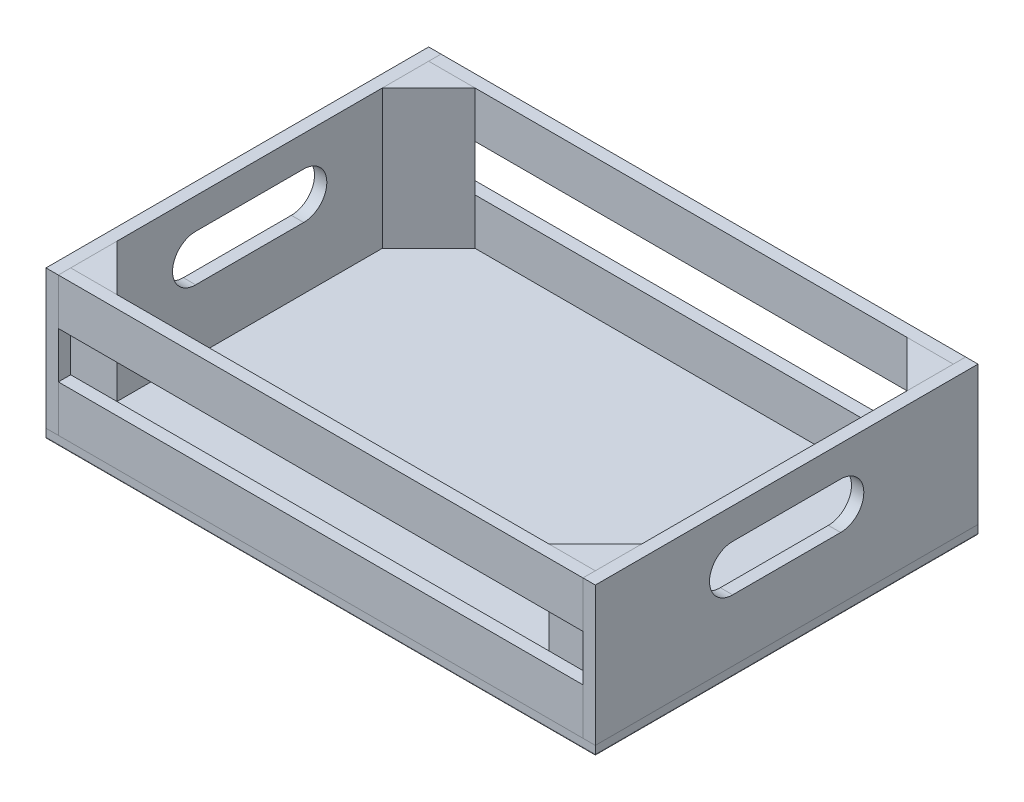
ISO-10303-21;
HEADER;
FILE_DESCRIPTION(('STEP AP214'),'2;1');
FILE_NAME('part.step','',(''),(''),'','','');
FILE_SCHEMA(('AUTOMOTIVE_DESIGN { 1 0 10303 214 1 1 1 1 }'));
ENDSEC;
DATA;
#1=APPLICATION_CONTEXT('core data for automotive mechanical design processes');
#2=APPLICATION_PROTOCOL_DEFINITION('international standard','automotive_design',2000,#1);
#3=PRODUCT_CONTEXT('',#1,'mechanical');
#4=PRODUCT('Part','Part','',(#3));
#5=PRODUCT_RELATED_PRODUCT_CATEGORY('part','',(#4));
#6=PRODUCT_DEFINITION_FORMATION('','',#4);
#7=PRODUCT_DEFINITION_CONTEXT('part definition',#1,'design');
#8=PRODUCT_DEFINITION('design','',#6,#7);
#9=PRODUCT_DEFINITION_SHAPE('','',#8);
#10=(LENGTH_UNIT() NAMED_UNIT(*) SI_UNIT(.MILLI.,.METRE.));
#11=(NAMED_UNIT(*) PLANE_ANGLE_UNIT() SI_UNIT($,.RADIAN.));
#12=(NAMED_UNIT(*) SI_UNIT($,.STERADIAN.) SOLID_ANGLE_UNIT());
#13=UNCERTAINTY_MEASURE_WITH_UNIT(LENGTH_MEASURE(1.E-05),#10,'distance_accuracy_value','');
#14=(GEOMETRIC_REPRESENTATION_CONTEXT(3) GLOBAL_UNCERTAINTY_ASSIGNED_CONTEXT((#13)) GLOBAL_UNIT_ASSIGNED_CONTEXT((#10,
#11,#12)) REPRESENTATION_CONTEXT('',''));
#15=CARTESIAN_POINT('',(0.,0.,0.));
#16=DIRECTION('',(0.,0.,1.));
#17=DIRECTION('',(1.,0.,0.));
#18=AXIS2_PLACEMENT_3D('',#15,#16,#17);
#19=CARTESIAN_POINT('',(70.,45.,0.));
#20=DIRECTION('',(0.,0.,-1.));
#21=DIRECTION('',(-1.,0.,0.));
#22=AXIS2_PLACEMENT_3D('',#19,#20,#21);
#23=PLANE('',#22);
#24=DIRECTION('',(1.,0.,0.));
#25=VECTOR('',#24,1.);
#26=CARTESIAN_POINT('',(70.,0.,0.));
#27=LINE('',#26,#25);
#28=CARTESIAN_POINT('',(70.,0.,0.));
#29=VERTEX_POINT('',#28);
#30=CARTESIAN_POINT('',(85.,0.,0.));
#31=VERTEX_POINT('',#30);
#32=EDGE_CURVE('E98',#29,#31,#27,.T.);
#33=ORIENTED_EDGE('',*,*,#32,.T.);
#34=DIRECTION('',(0.,-1.,0.));
#35=VECTOR('',#34,1.);
#36=CARTESIAN_POINT('',(85.,45.,0.));
#37=LINE('',#36,#35);
#38=CARTESIAN_POINT('',(85.,45.,0.));
#39=VERTEX_POINT('',#38);
#40=EDGE_CURVE('E12',#39,#31,#37,.T.);
#41=ORIENTED_EDGE('',*,*,#40,.F.);
#42=DIRECTION('',(1.,0.,0.));
#43=VECTOR('',#42,1.);
#44=CARTESIAN_POINT('',(70.,45.,0.));
#45=LINE('',#44,#43);
#46=CARTESIAN_POINT('',(70.,45.,0.));
#47=VERTEX_POINT('',#46);
#48=EDGE_CURVE('E92',#47,#39,#45,.T.);
#49=ORIENTED_EDGE('',*,*,#48,.F.);
#50=DIRECTION('',(0.,-1.,0.));
#51=VECTOR('',#50,1.);
#52=CARTESIAN_POINT('',(70.,45.,0.));
#53=LINE('',#52,#51);
#54=EDGE_CURVE('E99',#47,#29,#53,.T.);
#55=ORIENTED_EDGE('',*,*,#54,.T.);
#56=EDGE_LOOP('',(#33,#41,#49,#55));
#57=FACE_BOUND('',#56,.T.);
#58=ADVANCED_FACE('F51',(#57),#23,.F.);
#59=CARTESIAN_POINT('',(85.,45.,0.));
#60=DIRECTION('',(-1.,0.,0.));
#61=DIRECTION('',(0.,0.,1.));
#62=AXIS2_PLACEMENT_3D('',#59,#60,#61);
#63=PLANE('',#62);
#64=DIRECTION('',(0.,0.,-1.));
#65=VECTOR('',#64,1.);
#66=CARTESIAN_POINT('',(85.,0.,0.));
#67=LINE('',#66,#65);
#68=CARTESIAN_POINT('',(85.,0.,-15.));
#69=VERTEX_POINT('',#68);
#70=EDGE_CURVE('E100',#31,#69,#67,.T.);
#71=ORIENTED_EDGE('',*,*,#70,.T.);
#72=DIRECTION('',(0.,-1.,0.));
#73=VECTOR('',#72,1.);
#74=CARTESIAN_POINT('',(85.,45.,-15.));
#75=LINE('',#74,#73);
#76=CARTESIAN_POINT('',(85.,45.,-15.));
#77=VERTEX_POINT('',#76);
#78=EDGE_CURVE('E59',#77,#69,#75,.T.);
#79=ORIENTED_EDGE('',*,*,#78,.F.);
#80=DIRECTION('',(0.,0.,-1.));
#81=VECTOR('',#80,1.);
#82=CARTESIAN_POINT('',(85.,45.,0.));
#83=LINE('',#82,#81);
#84=EDGE_CURVE('E87',#39,#77,#83,.T.);
#85=ORIENTED_EDGE('',*,*,#84,.F.);
#86=ORIENTED_EDGE('',*,*,#40,.T.);
#87=EDGE_LOOP('',(#71,#79,#85,#86));
#88=FACE_BOUND('',#87,.T.);
#89=ADVANCED_FACE('F89',(#88),#63,.F.);
#90=CARTESIAN_POINT('',(85.,45.,-15.));
#91=DIRECTION('',(0.707106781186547,0.,0.707106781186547));
#92=DIRECTION('',(0.707106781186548,0.,-0.707106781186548));
#93=AXIS2_PLACEMENT_3D('',#90,#91,#92);
#94=PLANE('',#93);
#95=DIRECTION('',(-0.707106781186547,0.,0.707106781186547));
#96=VECTOR('',#95,1.);
#97=CARTESIAN_POINT('',(85.,0.,-15.));
#98=LINE('',#97,#96);
#99=EDGE_CURVE('E80',#69,#29,#98,.T.);
#100=ORIENTED_EDGE('',*,*,#99,.T.);
#101=ORIENTED_EDGE('',*,*,#54,.F.);
#102=DIRECTION('',(-0.707106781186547,0.,0.707106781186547));
#103=VECTOR('',#102,1.);
#104=CARTESIAN_POINT('',(85.,45.,-15.));
#105=LINE('',#104,#103);
#106=EDGE_CURVE('E67',#77,#47,#105,.T.);
#107=ORIENTED_EDGE('',*,*,#106,.F.);
#108=ORIENTED_EDGE('',*,*,#78,.T.);
#109=EDGE_LOOP('',(#100,#101,#107,#108));
#110=FACE_BOUND('',#109,.T.);
#111=ADVANCED_FACE('F106',(#110),#94,.F.);
#112=CARTESIAN_POINT('',(0.,45.,-116.));
#113=DIRECTION('',(0.,1.,0.));
#114=DIRECTION('',(0.,0.,-1.));
#115=AXIS2_PLACEMENT_3D('',#112,#113,#114);
#116=PLANE('',#115);
#117=ORIENTED_EDGE('',*,*,#48,.T.);
#118=ORIENTED_EDGE('',*,*,#84,.T.);
#119=ORIENTED_EDGE('',*,*,#106,.T.);
#120=EDGE_LOOP('',(#117,#118,#119));
#121=FACE_BOUND('',#120,.T.);
#122=ADVANCED_FACE('F95',(#121),#116,.T.);
#123=CARTESIAN_POINT('',(0.,0.,-116.));
#124=DIRECTION('',(0.,1.,0.));
#125=DIRECTION('',(0.,0.,-1.));
#126=AXIS2_PLACEMENT_3D('',#123,#124,#125);
#127=PLANE('',#126);
#128=ORIENTED_EDGE('',*,*,#32,.F.);
#129=ORIENTED_EDGE('',*,*,#99,.F.);
#130=ORIENTED_EDGE('',*,*,#70,.F.);
#131=EDGE_LOOP('',(#128,#129,#130));
#132=FACE_BOUND('',#131,.T.);
#133=ADVANCED_FACE('F107',(#132),#127,.F.);
#134=CLOSED_SHELL('',(#58,#89,#111,#122,#133));
#135=MANIFOLD_SOLID_BREP('B2',#134);
#136=CARTESIAN_POINT('',(-70.,45.,0.));
#137=DIRECTION('',(0.,0.,-1.));
#138=DIRECTION('',(1.,0.,0.));
#139=AXIS2_PLACEMENT_3D('',#136,#137,#138);
#140=PLANE('',#139);
#141=DIRECTION('',(-1.,0.,0.));
#142=VECTOR('',#141,1.);
#143=CARTESIAN_POINT('',(-70.,0.,0.));
#144=LINE('',#143,#142);
#145=CARTESIAN_POINT('',(-70.,0.,0.));
#146=VERTEX_POINT('',#145);
#147=CARTESIAN_POINT('',(-85.,0.,0.));
#148=VERTEX_POINT('',#147);
#149=EDGE_CURVE('E220',#146,#148,#144,.T.);
#150=ORIENTED_EDGE('',*,*,#149,.F.);
#151=DIRECTION('',(0.,-1.,0.));
#152=VECTOR('',#151,1.);
#153=CARTESIAN_POINT('',(-70.,45.,0.));
#154=LINE('',#153,#152);
#155=CARTESIAN_POINT('',(-70.,45.,0.));
#156=VERTEX_POINT('',#155);
#157=EDGE_CURVE('E215',#156,#146,#154,.T.);
#158=ORIENTED_EDGE('',*,*,#157,.F.);
#159=DIRECTION('',(-1.,0.,0.));
#160=VECTOR('',#159,1.);
#161=CARTESIAN_POINT('',(-70.,45.,0.));
#162=LINE('',#161,#160);
#163=CARTESIAN_POINT('',(-85.,45.,0.));
#164=VERTEX_POINT('',#163);
#165=EDGE_CURVE('E207',#156,#164,#162,.T.);
#166=ORIENTED_EDGE('',*,*,#165,.T.);
#167=DIRECTION('',(0.,-1.,0.));
#168=VECTOR('',#167,1.);
#169=CARTESIAN_POINT('',(-85.,45.,0.));
#170=LINE('',#169,#168);
#171=EDGE_CURVE('E49',#164,#148,#170,.T.);
#172=ORIENTED_EDGE('',*,*,#171,.T.);
#173=EDGE_LOOP('',(#150,#158,#166,#172));
#174=FACE_BOUND('',#173,.T.);
#175=ADVANCED_FACE('F168',(#174),#140,.F.);
#176=CARTESIAN_POINT('',(-85.,45.,0.));
#177=DIRECTION('',(1.,0.,0.));
#178=DIRECTION('',(0.,0.,1.));
#179=AXIS2_PLACEMENT_3D('',#176,#177,#178);
#180=PLANE('',#179);
#181=DIRECTION('',(0.,0.,-1.));
#182=VECTOR('',#181,1.);
#183=CARTESIAN_POINT('',(-85.,0.,0.));
#184=LINE('',#183,#182);
#185=CARTESIAN_POINT('',(-85.,0.,-15.));
#186=VERTEX_POINT('',#185);
#187=EDGE_CURVE('E212',#148,#186,#184,.T.);
#188=ORIENTED_EDGE('',*,*,#187,.F.);
#189=ORIENTED_EDGE('',*,*,#171,.F.);
#190=DIRECTION('',(0.,0.,-1.));
#191=VECTOR('',#190,1.);
#192=CARTESIAN_POINT('',(-85.,45.,0.));
#193=LINE('',#192,#191);
#194=CARTESIAN_POINT('',(-85.,45.,-15.));
#195=VERTEX_POINT('',#194);
#196=EDGE_CURVE('E203',#164,#195,#193,.T.);
#197=ORIENTED_EDGE('',*,*,#196,.T.);
#198=DIRECTION('',(0.,-1.,0.));
#199=VECTOR('',#198,1.);
#200=CARTESIAN_POINT('',(-85.,45.,-15.));
#201=LINE('',#200,#199);
#202=EDGE_CURVE('E176',#195,#186,#201,.T.);
#203=ORIENTED_EDGE('',*,*,#202,.T.);
#204=EDGE_LOOP('',(#188,#189,#197,#203));
#205=FACE_BOUND('',#204,.T.);
#206=ADVANCED_FACE('F211',(#205),#180,.F.);
#207=CARTESIAN_POINT('',(-85.,45.,-15.));
#208=DIRECTION('',(-0.707106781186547,0.,0.707106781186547));
#209=DIRECTION('',(-0.707106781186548,0.,-0.707106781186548));
#210=AXIS2_PLACEMENT_3D('',#207,#208,#209);
#211=PLANE('',#210);
#212=DIRECTION('',(0.707106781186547,0.,0.707106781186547));
#213=VECTOR('',#212,1.);
#214=CARTESIAN_POINT('',(-85.,0.,-15.));
#215=LINE('',#214,#213);
#216=EDGE_CURVE('E195',#186,#146,#215,.T.);
#217=ORIENTED_EDGE('',*,*,#216,.F.);
#218=ORIENTED_EDGE('',*,*,#202,.F.);
#219=DIRECTION('',(0.707106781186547,0.,0.707106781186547));
#220=VECTOR('',#219,1.);
#221=CARTESIAN_POINT('',(-85.,45.,-15.));
#222=LINE('',#221,#220);
#223=EDGE_CURVE('E184',#195,#156,#222,.T.);
#224=ORIENTED_EDGE('',*,*,#223,.T.);
#225=ORIENTED_EDGE('',*,*,#157,.T.);
#226=EDGE_LOOP('',(#217,#218,#224,#225));
#227=FACE_BOUND('',#226,.T.);
#228=ADVANCED_FACE('F229',(#227),#211,.F.);
#229=CARTESIAN_POINT('',(0.,45.,-116.));
#230=DIRECTION('',(0.,1.,0.));
#231=DIRECTION('',(0.,0.,-1.));
#232=AXIS2_PLACEMENT_3D('',#229,#230,#231);
#233=PLANE('',#232);
#234=ORIENTED_EDGE('',*,*,#165,.F.);
#235=ORIENTED_EDGE('',*,*,#223,.F.);
#236=ORIENTED_EDGE('',*,*,#196,.F.);
#237=EDGE_LOOP('',(#234,#235,#236));
#238=FACE_BOUND('',#237,.T.);
#239=ADVANCED_FACE('F205',(#238),#233,.T.);
#240=CARTESIAN_POINT('',(0.,0.,-116.));
#241=DIRECTION('',(0.,1.,0.));
#242=DIRECTION('',(0.,0.,-1.));
#243=AXIS2_PLACEMENT_3D('',#240,#241,#242);
#244=PLANE('',#243);
#245=ORIENTED_EDGE('',*,*,#149,.T.);
#246=ORIENTED_EDGE('',*,*,#187,.T.);
#247=ORIENTED_EDGE('',*,*,#216,.T.);
#248=EDGE_LOOP('',(#245,#246,#247));
#249=FACE_BOUND('',#248,.T.);
#250=ADVANCED_FACE('F223',(#249),#244,.F.);
#251=CLOSED_SHELL('',(#175,#206,#228,#239,#250));
#252=MANIFOLD_SOLID_BREP('B6',#251);
#253=CARTESIAN_POINT('',(70.,45.,-116.));
#254=DIRECTION('',(0.,0.,1.));
#255=DIRECTION('',(-1.,0.,0.));
#256=AXIS2_PLACEMENT_3D('',#253,#254,#255);
#257=PLANE('',#256);
#258=DIRECTION('',(1.,0.,0.));
#259=VECTOR('',#258,1.);
#260=CARTESIAN_POINT('',(70.,0.,-116.));
#261=LINE('',#260,#259);
#262=CARTESIAN_POINT('',(70.,0.,-116.));
#263=VERTEX_POINT('',#262);
#264=CARTESIAN_POINT('',(85.,0.,-116.));
#265=VERTEX_POINT('',#264);
#266=EDGE_CURVE('E337',#263,#265,#261,.T.);
#267=ORIENTED_EDGE('',*,*,#266,.F.);
#268=DIRECTION('',(0.,-1.,0.));
#269=VECTOR('',#268,1.);
#270=CARTESIAN_POINT('',(70.,45.,-116.));
#271=LINE('',#270,#269);
#272=CARTESIAN_POINT('',(70.,45.,-116.));
#273=VERTEX_POINT('',#272);
#274=EDGE_CURVE('E332',#273,#263,#271,.T.);
#275=ORIENTED_EDGE('',*,*,#274,.F.);
#276=DIRECTION('',(1.,0.,0.));
#277=VECTOR('',#276,1.);
#278=CARTESIAN_POINT('',(70.,45.,-116.));
#279=LINE('',#278,#277);
#280=CARTESIAN_POINT('',(85.,45.,-116.));
#281=VERTEX_POINT('',#280);
#282=EDGE_CURVE('E324',#273,#281,#279,.T.);
#283=ORIENTED_EDGE('',*,*,#282,.T.);
#284=DIRECTION('',(0.,-1.,0.));
#285=VECTOR('',#284,1.);
#286=CARTESIAN_POINT('',(85.,45.,-116.));
#287=LINE('',#286,#285);
#288=EDGE_CURVE('E166',#281,#265,#287,.T.);
#289=ORIENTED_EDGE('',*,*,#288,.T.);
#290=EDGE_LOOP('',(#267,#275,#283,#289));
#291=FACE_BOUND('',#290,.T.);
#292=ADVANCED_FACE('F285',(#291),#257,.F.);
#293=CARTESIAN_POINT('',(85.,45.,-116.));
#294=DIRECTION('',(-1.,0.,0.));
#295=DIRECTION('',(0.,0.,-1.));
#296=AXIS2_PLACEMENT_3D('',#293,#294,#295);
#297=PLANE('',#296);
#298=DIRECTION('',(0.,0.,1.));
#299=VECTOR('',#298,1.);
#300=CARTESIAN_POINT('',(85.,0.,-116.));
#301=LINE('',#300,#299);
#302=CARTESIAN_POINT('',(85.,0.,-101.));
#303=VERTEX_POINT('',#302);
#304=EDGE_CURVE('E329',#265,#303,#301,.T.);
#305=ORIENTED_EDGE('',*,*,#304,.F.);
#306=ORIENTED_EDGE('',*,*,#288,.F.);
#307=DIRECTION('',(0.,0.,1.));
#308=VECTOR('',#307,1.);
#309=CARTESIAN_POINT('',(85.,45.,-116.));
#310=LINE('',#309,#308);
#311=CARTESIAN_POINT('',(85.,45.,-101.));
#312=VERTEX_POINT('',#311);
#313=EDGE_CURVE('E320',#281,#312,#310,.T.);
#314=ORIENTED_EDGE('',*,*,#313,.T.);
#315=DIRECTION('',(0.,-1.,0.));
#316=VECTOR('',#315,1.);
#317=CARTESIAN_POINT('',(85.,45.,-101.));
#318=LINE('',#317,#316);
#319=EDGE_CURVE('E293',#312,#303,#318,.T.);
#320=ORIENTED_EDGE('',*,*,#319,.T.);
#321=EDGE_LOOP('',(#305,#306,#314,#320));
#322=FACE_BOUND('',#321,.T.);
#323=ADVANCED_FACE('F328',(#322),#297,.F.);
#324=CARTESIAN_POINT('',(85.,45.,-101.));
#325=DIRECTION('',(0.707106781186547,0.,-0.707106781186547));
#326=DIRECTION('',(0.707106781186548,0.,0.707106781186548));
#327=AXIS2_PLACEMENT_3D('',#324,#325,#326);
#328=PLANE('',#327);
#329=DIRECTION('',(-0.707106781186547,0.,-0.707106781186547));
#330=VECTOR('',#329,1.);
#331=CARTESIAN_POINT('',(85.,0.,-101.));
#332=LINE('',#331,#330);
#333=EDGE_CURVE('E312',#303,#263,#332,.T.);
#334=ORIENTED_EDGE('',*,*,#333,.F.);
#335=ORIENTED_EDGE('',*,*,#319,.F.);
#336=DIRECTION('',(-0.707106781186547,0.,-0.707106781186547));
#337=VECTOR('',#336,1.);
#338=CARTESIAN_POINT('',(85.,45.,-101.));
#339=LINE('',#338,#337);
#340=EDGE_CURVE('E301',#312,#273,#339,.T.);
#341=ORIENTED_EDGE('',*,*,#340,.T.);
#342=ORIENTED_EDGE('',*,*,#274,.T.);
#343=EDGE_LOOP('',(#334,#335,#341,#342));
#344=FACE_BOUND('',#343,.T.);
#345=ADVANCED_FACE('F346',(#344),#328,.F.);
#346=CARTESIAN_POINT('',(0.,45.,0.));
#347=DIRECTION('',(0.,1.,0.));
#348=DIRECTION('',(0.,0.,1.));
#349=AXIS2_PLACEMENT_3D('',#346,#347,#348);
#350=PLANE('',#349);
#351=ORIENTED_EDGE('',*,*,#282,.F.);
#352=ORIENTED_EDGE('',*,*,#340,.F.);
#353=ORIENTED_EDGE('',*,*,#313,.F.);
#354=EDGE_LOOP('',(#351,#352,#353));
#355=FACE_BOUND('',#354,.T.);
#356=ADVANCED_FACE('F322',(#355),#350,.T.);
#357=CARTESIAN_POINT('',(0.,0.,0.));
#358=DIRECTION('',(0.,1.,0.));
#359=DIRECTION('',(0.,0.,1.));
#360=AXIS2_PLACEMENT_3D('',#357,#358,#359);
#361=PLANE('',#360);
#362=ORIENTED_EDGE('',*,*,#266,.T.);
#363=ORIENTED_EDGE('',*,*,#304,.T.);
#364=ORIENTED_EDGE('',*,*,#333,.T.);
#365=EDGE_LOOP('',(#362,#363,#364));
#366=FACE_BOUND('',#365,.T.);
#367=ADVANCED_FACE('F340',(#366),#361,.F.);
#368=CLOSED_SHELL('',(#292,#323,#345,#356,#367));
#369=MANIFOLD_SOLID_BREP('B43',#368);
#370=CARTESIAN_POINT('',(-70.,45.,-116.));
#371=DIRECTION('',(0.,0.,1.));
#372=DIRECTION('',(1.,0.,0.));
#373=AXIS2_PLACEMENT_3D('',#370,#371,#372);
#374=PLANE('',#373);
#375=DIRECTION('',(-1.,0.,0.));
#376=VECTOR('',#375,1.);
#377=CARTESIAN_POINT('',(-70.,0.,-116.));
#378=LINE('',#377,#376);
#379=CARTESIAN_POINT('',(-70.,0.,-116.));
#380=VERTEX_POINT('',#379);
#381=CARTESIAN_POINT('',(-85.,0.,-116.));
#382=VERTEX_POINT('',#381);
#383=EDGE_CURVE('E449',#380,#382,#378,.T.);
#384=ORIENTED_EDGE('',*,*,#383,.T.);
#385=DIRECTION('',(0.,-1.,0.));
#386=VECTOR('',#385,1.);
#387=CARTESIAN_POINT('',(-85.,45.,-116.));
#388=LINE('',#387,#386);
#389=CARTESIAN_POINT('',(-85.,45.,-116.));
#390=VERTEX_POINT('',#389);
#391=EDGE_CURVE('E283',#390,#382,#388,.T.);
#392=ORIENTED_EDGE('',*,*,#391,.F.);
#393=DIRECTION('',(-1.,0.,0.));
#394=VECTOR('',#393,1.);
#395=CARTESIAN_POINT('',(-70.,45.,-116.));
#396=LINE('',#395,#394);
#397=CARTESIAN_POINT('',(-70.,45.,-116.));
#398=VERTEX_POINT('',#397);
#399=EDGE_CURVE('E442',#398,#390,#396,.T.);
#400=ORIENTED_EDGE('',*,*,#399,.F.);
#401=DIRECTION('',(0.,-1.,0.));
#402=VECTOR('',#401,1.);
#403=CARTESIAN_POINT('',(-70.,45.,-116.));
#404=LINE('',#403,#402);
#405=EDGE_CURVE('E450',#398,#380,#404,.T.);
#406=ORIENTED_EDGE('',*,*,#405,.T.);
#407=EDGE_LOOP('',(#384,#392,#400,#406));
#408=FACE_BOUND('',#407,.T.);
#409=ADVANCED_FACE('F402',(#408),#374,.F.);
#410=CARTESIAN_POINT('',(-85.,45.,-116.));
#411=DIRECTION('',(1.,0.,0.));
#412=DIRECTION('',(0.,0.,-1.));
#413=AXIS2_PLACEMENT_3D('',#410,#411,#412);
#414=PLANE('',#413);
#415=DIRECTION('',(0.,0.,1.));
#416=VECTOR('',#415,1.);
#417=CARTESIAN_POINT('',(-85.,0.,-116.));
#418=LINE('',#417,#416);
#419=CARTESIAN_POINT('',(-85.,0.,-101.));
#420=VERTEX_POINT('',#419);
#421=EDGE_CURVE('E430',#382,#420,#418,.T.);
#422=ORIENTED_EDGE('',*,*,#421,.T.);
#423=DIRECTION('',(0.,-1.,0.));
#424=VECTOR('',#423,1.);
#425=CARTESIAN_POINT('',(-85.,45.,-101.));
#426=LINE('',#425,#424);
#427=CARTESIAN_POINT('',(-85.,45.,-101.));
#428=VERTEX_POINT('',#427);
#429=EDGE_CURVE('E410',#428,#420,#426,.T.);
#430=ORIENTED_EDGE('',*,*,#429,.F.);
#431=DIRECTION('',(0.,0.,1.));
#432=VECTOR('',#431,1.);
#433=CARTESIAN_POINT('',(-85.,45.,-116.));
#434=LINE('',#433,#432);
#435=EDGE_CURVE('E438',#390,#428,#434,.T.);
#436=ORIENTED_EDGE('',*,*,#435,.F.);
#437=ORIENTED_EDGE('',*,*,#391,.T.);
#438=EDGE_LOOP('',(#422,#430,#436,#437));
#439=FACE_BOUND('',#438,.T.);
#440=ADVANCED_FACE('F439',(#439),#414,.F.);
#441=CARTESIAN_POINT('',(-85.,45.,-101.));
#442=DIRECTION('',(-0.707106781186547,0.,-0.707106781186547));
#443=DIRECTION('',(-0.707106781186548,0.,0.707106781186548));
#444=AXIS2_PLACEMENT_3D('',#441,#442,#443);
#445=PLANE('',#444);
#446=DIRECTION('',(0.707106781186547,0.,-0.707106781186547));
#447=VECTOR('',#446,1.);
#448=CARTESIAN_POINT('',(-85.,0.,-101.));
#449=LINE('',#448,#447);
#450=EDGE_CURVE('E435',#420,#380,#449,.T.);
#451=ORIENTED_EDGE('',*,*,#450,.T.);
#452=ORIENTED_EDGE('',*,*,#405,.F.);
#453=DIRECTION('',(0.707106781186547,0.,-0.707106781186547));
#454=VECTOR('',#453,1.);
#455=CARTESIAN_POINT('',(-85.,45.,-101.));
#456=LINE('',#455,#454);
#457=EDGE_CURVE('E418',#428,#398,#456,.T.);
#458=ORIENTED_EDGE('',*,*,#457,.F.);
#459=ORIENTED_EDGE('',*,*,#429,.T.);
#460=EDGE_LOOP('',(#451,#452,#458,#459));
#461=FACE_BOUND('',#460,.T.);
#462=ADVANCED_FACE('F457',(#461),#445,.F.);
#463=CARTESIAN_POINT('',(0.,45.,0.));
#464=DIRECTION('',(0.,1.,0.));
#465=DIRECTION('',(0.,0.,1.));
#466=AXIS2_PLACEMENT_3D('',#463,#464,#465);
#467=PLANE('',#466);
#468=ORIENTED_EDGE('',*,*,#399,.T.);
#469=ORIENTED_EDGE('',*,*,#435,.T.);
#470=ORIENTED_EDGE('',*,*,#457,.T.);
#471=EDGE_LOOP('',(#468,#469,#470));
#472=FACE_BOUND('',#471,.T.);
#473=ADVANCED_FACE('F445',(#472),#467,.T.);
#474=CARTESIAN_POINT('',(0.,0.,0.));
#475=DIRECTION('',(0.,1.,0.));
#476=DIRECTION('',(0.,0.,1.));
#477=AXIS2_PLACEMENT_3D('',#474,#475,#476);
#478=PLANE('',#477);
#479=ORIENTED_EDGE('',*,*,#383,.F.);
#480=ORIENTED_EDGE('',*,*,#450,.F.);
#481=ORIENTED_EDGE('',*,*,#421,.F.);
#482=EDGE_LOOP('',(#479,#480,#481));
#483=FACE_BOUND('',#482,.T.);
#484=ADVANCED_FACE('F458',(#483),#478,.F.);
#485=CLOSED_SHELL('',(#409,#440,#462,#473,#484));
#486=MANIFOLD_SOLID_BREP('B160',#485);
#487=CARTESIAN_POINT('',(-89.,-3.,4.));
#488=DIRECTION('',(1.,0.,0.));
#489=DIRECTION('',(0.,0.,-1.));
#490=AXIS2_PLACEMENT_3D('',#487,#488,#489);
#491=PLANE('',#490);
#492=DIRECTION('',(0.,1.,0.));
#493=VECTOR('',#492,1.);
#494=CARTESIAN_POINT('',(-89.,-3.,-120.));
#495=LINE('',#494,#493);
#496=CARTESIAN_POINT('',(-89.,-2.5,-120.));
#497=VERTEX_POINT('',#496);
#498=CARTESIAN_POINT('',(-89.,0.,-120.));
#499=VERTEX_POINT('',#498);
#500=EDGE_CURVE('E561',#497,#499,#495,.T.);
#501=ORIENTED_EDGE('',*,*,#500,.F.);
#502=DIRECTION('',(0.,0.,-1.));
#503=VECTOR('',#502,1.);
#504=CARTESIAN_POINT('',(-89.,-2.5,4.));
#505=LINE('',#504,#503);
#506=CARTESIAN_POINT('',(-89.,-2.5,4.));
#507=VERTEX_POINT('',#506);
#508=EDGE_CURVE('E400',#497,#507,#505,.F.);
#509=ORIENTED_EDGE('',*,*,#508,.T.);
#510=DIRECTION('',(0.,1.,0.));
#511=VECTOR('',#510,1.);
#512=CARTESIAN_POINT('',(-89.,-3.,4.));
#513=LINE('',#512,#511);
#514=CARTESIAN_POINT('',(-89.,0.,4.));
#515=VERTEX_POINT('',#514);
#516=EDGE_CURVE('E581',#507,#515,#513,.T.);
#517=ORIENTED_EDGE('',*,*,#516,.T.);
#518=DIRECTION('',(0.,0.,-1.));
#519=VECTOR('',#518,1.);
#520=CARTESIAN_POINT('',(-89.,0.,4.));
#521=LINE('',#520,#519);
#522=EDGE_CURVE('E576',#515,#499,#521,.T.);
#523=ORIENTED_EDGE('',*,*,#522,.T.);
#524=EDGE_LOOP('',(#501,#509,#517,#523));
#525=FACE_BOUND('',#524,.T.);
#526=ADVANCED_FACE('F509',(#525),#491,.F.);
#527=CARTESIAN_POINT('',(-89.,-3.,-120.));
#528=DIRECTION('',(0.,0.,1.));
#529=DIRECTION('',(1.,0.,0.));
#530=AXIS2_PLACEMENT_3D('',#527,#528,#529);
#531=PLANE('',#530);
#532=DIRECTION('',(0.,1.,0.));
#533=VECTOR('',#532,1.);
#534=CARTESIAN_POINT('',(89.,-3.,-120.));
#535=LINE('',#534,#533);
#536=CARTESIAN_POINT('',(89.,-2.5,-120.));
#537=VERTEX_POINT('',#536);
#538=CARTESIAN_POINT('',(89.,0.,-120.));
#539=VERTEX_POINT('',#538);
#540=EDGE_CURVE('E570',#537,#539,#535,.T.);
#541=ORIENTED_EDGE('',*,*,#540,.F.);
#542=DIRECTION('',(1.,0.,0.));
#543=VECTOR('',#542,1.);
#544=CARTESIAN_POINT('',(-89.,-2.5,-120.));
#545=LINE('',#544,#543);
#546=EDGE_CURVE('E518',#537,#497,#545,.F.);
#547=ORIENTED_EDGE('',*,*,#546,.T.);
#548=ORIENTED_EDGE('',*,*,#500,.T.);
#549=DIRECTION('',(1.,0.,0.));
#550=VECTOR('',#549,1.);
#551=CARTESIAN_POINT('',(-89.,0.,-120.));
#552=LINE('',#551,#550);
#553=EDGE_CURVE('E564',#499,#539,#552,.T.);
#554=ORIENTED_EDGE('',*,*,#553,.T.);
#555=EDGE_LOOP('',(#541,#547,#548,#554));
#556=FACE_BOUND('',#555,.T.);
#557=ADVANCED_FACE('F563',(#556),#531,.F.);
#558=CARTESIAN_POINT('',(89.,-3.,4.));
#559=DIRECTION('',(-1.,0.,0.));
#560=DIRECTION('',(0.,0.,1.));
#561=AXIS2_PLACEMENT_3D('',#558,#559,#560);
#562=PLANE('',#561);
#563=DIRECTION('',(0.,1.,0.));
#564=VECTOR('',#563,1.);
#565=CARTESIAN_POINT('',(89.,-3.,4.));
#566=LINE('',#565,#564);
#567=CARTESIAN_POINT('',(89.,-2.5,4.));
#568=VERTEX_POINT('',#567);
#569=CARTESIAN_POINT('',(89.,0.,4.));
#570=VERTEX_POINT('',#569);
#571=EDGE_CURVE('E591',#568,#570,#566,.T.);
#572=ORIENTED_EDGE('',*,*,#571,.F.);
#573=DIRECTION('',(0.,0.,1.));
#574=VECTOR('',#573,1.);
#575=CARTESIAN_POINT('',(89.,-2.5,-120.));
#576=LINE('',#575,#574);
#577=EDGE_CURVE('E533',#568,#537,#576,.F.);
#578=ORIENTED_EDGE('',*,*,#577,.T.);
#579=ORIENTED_EDGE('',*,*,#540,.T.);
#580=DIRECTION('',(0.,0.,1.));
#581=VECTOR('',#580,1.);
#582=CARTESIAN_POINT('',(89.,0.,4.));
#583=LINE('',#582,#581);
#584=EDGE_CURVE('E578',#539,#570,#583,.T.);
#585=ORIENTED_EDGE('',*,*,#584,.T.);
#586=EDGE_LOOP('',(#572,#578,#579,#585));
#587=FACE_BOUND('',#586,.T.);
#588=ADVANCED_FACE('F629',(#587),#562,.F.);
#589=CARTESIAN_POINT('',(-89.,-3.,4.));
#590=DIRECTION('',(0.,0.,-1.));
#591=DIRECTION('',(-1.,0.,0.));
#592=AXIS2_PLACEMENT_3D('',#589,#590,#591);
#593=PLANE('',#592);
#594=ORIENTED_EDGE('',*,*,#516,.F.);
#595=DIRECTION('',(-1.,0.,0.));
#596=VECTOR('',#595,1.);
#597=CARTESIAN_POINT('',(89.,-2.5,4.));
#598=LINE('',#597,#596);
#599=EDGE_CURVE('E602',#507,#568,#598,.F.);
#600=ORIENTED_EDGE('',*,*,#599,.T.);
#601=ORIENTED_EDGE('',*,*,#571,.T.);
#602=DIRECTION('',(-1.,0.,0.));
#603=VECTOR('',#602,1.);
#604=CARTESIAN_POINT('',(-89.,0.,4.));
#605=LINE('',#604,#603);
#606=EDGE_CURVE('E588',#570,#515,#605,.T.);
#607=ORIENTED_EDGE('',*,*,#606,.T.);
#608=EDGE_LOOP('',(#594,#600,#601,#607));
#609=FACE_BOUND('',#608,.T.);
#610=ADVANCED_FACE('F628',(#609),#593,.F.);
#611=CARTESIAN_POINT('',(0.,-3.,0.));
#612=DIRECTION('',(0.,-1.,0.));
#613=DIRECTION('',(0.,0.,-1.));
#614=AXIS2_PLACEMENT_3D('',#611,#612,#613);
#615=PLANE('',#614);
#616=DIRECTION('',(0.,0.,1.));
#617=VECTOR('',#616,1.);
#618=CARTESIAN_POINT('',(88.5,-3.,4.));
#619=LINE('',#618,#617);
#620=CARTESIAN_POINT('',(88.5,-3.,-119.5));
#621=VERTEX_POINT('',#620);
#622=CARTESIAN_POINT('',(88.5,-3.,3.5));
#623=VERTEX_POINT('',#622);
#624=EDGE_CURVE('E597',#621,#623,#619,.T.);
#625=ORIENTED_EDGE('',*,*,#624,.T.);
#626=DIRECTION('',(-1.,0.,0.));
#627=VECTOR('',#626,1.);
#628=CARTESIAN_POINT('',(-89.,-3.,3.5));
#629=LINE('',#628,#627);
#630=CARTESIAN_POINT('',(-88.5,-3.,3.5));
#631=VERTEX_POINT('',#630);
#632=EDGE_CURVE('E599',#623,#631,#629,.T.);
#633=ORIENTED_EDGE('',*,*,#632,.T.);
#634=DIRECTION('',(0.,0.,-1.));
#635=VECTOR('',#634,1.);
#636=CARTESIAN_POINT('',(-88.5,-3.,-120.));
#637=LINE('',#636,#635);
#638=CARTESIAN_POINT('',(-88.5,-3.,-119.5));
#639=VERTEX_POINT('',#638);
#640=EDGE_CURVE('E569',#631,#639,#637,.T.);
#641=ORIENTED_EDGE('',*,*,#640,.T.);
#642=DIRECTION('',(1.,0.,0.));
#643=VECTOR('',#642,1.);
#644=CARTESIAN_POINT('',(89.,-3.,-119.5));
#645=LINE('',#644,#643);
#646=EDGE_CURVE('E595',#639,#621,#645,.T.);
#647=ORIENTED_EDGE('',*,*,#646,.T.);
#648=EDGE_LOOP('',(#625,#633,#641,#647));
#649=FACE_BOUND('',#648,.T.);
#650=ADVANCED_FACE('F621',(#649),#615,.T.);
#651=CARTESIAN_POINT('',(0.,0.,0.));
#652=DIRECTION('',(0.,-1.,0.));
#653=DIRECTION('',(0.,0.,-1.));
#654=AXIS2_PLACEMENT_3D('',#651,#652,#653);
#655=PLANE('',#654);
#656=ORIENTED_EDGE('',*,*,#522,.F.);
#657=ORIENTED_EDGE('',*,*,#606,.F.);
#658=ORIENTED_EDGE('',*,*,#584,.F.);
#659=ORIENTED_EDGE('',*,*,#553,.F.);
#660=EDGE_LOOP('',(#656,#657,#658,#659));
#661=FACE_BOUND('',#660,.T.);
#662=ADVANCED_FACE('F574',(#661),#655,.F.);
#663=CARTESIAN_POINT('',(0.,-2.5,-119.5));
#664=DIRECTION('',(-1.,0.,0.));
#665=DIRECTION('',(0.,0.,1.));
#666=AXIS2_PLACEMENT_3D('',#663,#664,#665);
#667=CYLINDRICAL_SURFACE('',#666,0.5);
#668=CARTESIAN_POINT('',(-88.5,-2.5,-119.5));
#669=DIRECTION('',(-0.707106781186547,0.,0.707106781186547));
#670=DIRECTION('',(0.707106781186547,0.,0.707106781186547));
#671=AXIS2_PLACEMENT_3D('',#668,#669,#670);
#672=ELLIPSE('',#671,0.707106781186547,0.5);
#673=EDGE_CURVE('E585',#497,#639,#672,.T.);
#674=ORIENTED_EDGE('',*,*,#673,.F.);
#675=ORIENTED_EDGE('',*,*,#546,.F.);
#676=CARTESIAN_POINT('',(88.5,-2.5,-119.5));
#677=DIRECTION('',(-0.707106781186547,0.,-0.707106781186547));
#678=DIRECTION('',(-0.707106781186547,0.,0.707106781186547));
#679=AXIS2_PLACEMENT_3D('',#676,#677,#678);
#680=ELLIPSE('',#679,0.707106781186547,0.5);
#681=EDGE_CURVE('E513',#621,#537,#680,.F.);
#682=ORIENTED_EDGE('',*,*,#681,.F.);
#683=ORIENTED_EDGE('',*,*,#646,.F.);
#684=EDGE_LOOP('',(#674,#675,#682,#683));
#685=FACE_BOUND('',#684,.T.);
#686=ADVANCED_FACE('F511',(#685),#667,.T.);
#687=CARTESIAN_POINT('',(88.5,-2.5,0.));
#688=DIRECTION('',(0.,0.,-1.));
#689=DIRECTION('',(-1.,0.,0.));
#690=AXIS2_PLACEMENT_3D('',#687,#688,#689);
#691=CYLINDRICAL_SURFACE('',#690,0.5);
#692=ORIENTED_EDGE('',*,*,#681,.T.);
#693=ORIENTED_EDGE('',*,*,#577,.F.);
#694=CARTESIAN_POINT('',(88.5,-2.5,3.5));
#695=DIRECTION('',(0.707106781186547,0.,-0.707106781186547));
#696=DIRECTION('',(-0.707106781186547,0.,-0.707106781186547));
#697=AXIS2_PLACEMENT_3D('',#694,#695,#696);
#698=ELLIPSE('',#697,0.707106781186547,0.5);
#699=EDGE_CURVE('E609',#623,#568,#698,.F.);
#700=ORIENTED_EDGE('',*,*,#699,.F.);
#701=ORIENTED_EDGE('',*,*,#624,.F.);
#702=EDGE_LOOP('',(#692,#693,#700,#701));
#703=FACE_BOUND('',#702,.T.);
#704=ADVANCED_FACE('F646',(#703),#691,.T.);
#705=CARTESIAN_POINT('',(-88.5,-2.5,0.));
#706=DIRECTION('',(0.,0.,1.));
#707=DIRECTION('',(1.,0.,0.));
#708=AXIS2_PLACEMENT_3D('',#705,#706,#707);
#709=CYLINDRICAL_SURFACE('',#708,0.5);
#710=ORIENTED_EDGE('',*,*,#673,.T.);
#711=ORIENTED_EDGE('',*,*,#640,.F.);
#712=CARTESIAN_POINT('',(-88.5,-2.5,3.5));
#713=DIRECTION('',(0.707106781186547,0.,0.707106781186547));
#714=DIRECTION('',(-0.707106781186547,0.,0.707106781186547));
#715=AXIS2_PLACEMENT_3D('',#712,#713,#714);
#716=ELLIPSE('',#715,0.707106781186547,0.5);
#717=EDGE_CURVE('E607',#507,#631,#716,.T.);
#718=ORIENTED_EDGE('',*,*,#717,.F.);
#719=ORIENTED_EDGE('',*,*,#508,.F.);
#720=EDGE_LOOP('',(#710,#711,#718,#719));
#721=FACE_BOUND('',#720,.T.);
#722=ADVANCED_FACE('F614',(#721),#709,.T.);
#723=CARTESIAN_POINT('',(0.,-2.5,3.5));
#724=DIRECTION('',(1.,0.,0.));
#725=DIRECTION('',(0.,0.,-1.));
#726=AXIS2_PLACEMENT_3D('',#723,#724,#725);
#727=CYLINDRICAL_SURFACE('',#726,0.5);
#728=ORIENTED_EDGE('',*,*,#699,.T.);
#729=ORIENTED_EDGE('',*,*,#599,.F.);
#730=ORIENTED_EDGE('',*,*,#717,.T.);
#731=ORIENTED_EDGE('',*,*,#632,.F.);
#732=EDGE_LOOP('',(#728,#729,#730,#731));
#733=FACE_BOUND('',#732,.T.);
#734=ADVANCED_FACE('F625',(#733),#727,.T.);
#735=CLOSED_SHELL('',(#526,#557,#588,#610,#650,#662,#686,#704,#722,#734));
#736=MANIFOLD_SOLID_BREP('B277',#735);
#737=CARTESIAN_POINT('',(89.,0.,0.));
#738=DIRECTION('',(1.,0.,0.));
#739=DIRECTION('',(0.,0.,1.));
#740=AXIS2_PLACEMENT_3D('',#737,#738,#739);
#741=PLANE('',#740);
#742=DIRECTION('',(0.,-1.,0.));
#743=VECTOR('',#742,1.);
#744=CARTESIAN_POINT('',(89.,45.,-120.));
#745=LINE('',#744,#743);
#746=CARTESIAN_POINT('',(89.,45.,-120.));
#747=VERTEX_POINT('',#746);
#748=CARTESIAN_POINT('',(89.,0.,-120.));
#749=VERTEX_POINT('',#748);
#750=EDGE_CURVE('E821',#747,#749,#745,.T.);
#751=ORIENTED_EDGE('',*,*,#750,.F.);
#752=DIRECTION('',(0.,0.,-1.));
#753=VECTOR('',#752,1.);
#754=CARTESIAN_POINT('',(89.,45.,-120.));
#755=LINE('',#754,#753);
#756=CARTESIAN_POINT('',(89.,45.,4.));
#757=VERTEX_POINT('',#756);
#758=EDGE_CURVE('E831',#757,#747,#755,.T.);
#759=ORIENTED_EDGE('',*,*,#758,.F.);
#760=DIRECTION('',(0.,1.,0.));
#761=VECTOR('',#760,1.);
#762=CARTESIAN_POINT('',(89.,45.,4.));
#763=LINE('',#762,#761);
#764=CARTESIAN_POINT('',(89.,0.,4.));
#765=VERTEX_POINT('',#764);
#766=EDGE_CURVE('E828',#765,#757,#763,.T.);
#767=ORIENTED_EDGE('',*,*,#766,.F.);
#768=DIRECTION('',(0.,0.,1.));
#769=VECTOR('',#768,1.);
#770=CARTESIAN_POINT('',(89.,0.,-120.));
#771=LINE('',#770,#769);
#772=EDGE_CURVE('E824',#749,#765,#771,.T.);
#773=ORIENTED_EDGE('',*,*,#772,.F.);
#774=EDGE_LOOP('',(#751,#759,#767,#773));
#775=FACE_BOUND('',#774,.T.);
#776=DIRECTION('',(0.,0.,1.));
#777=VECTOR('',#776,1.);
#778=CARTESIAN_POINT('',(89.,20.,-75.5));
#779=LINE('',#778,#777);
#780=CARTESIAN_POINT('',(89.,20.,-75.5));
#781=VERTEX_POINT('',#780);
#782=CARTESIAN_POINT('',(89.,20.,-40.5));
#783=VERTEX_POINT('',#782);
#784=EDGE_CURVE('E802',#781,#783,#779,.T.);
#785=ORIENTED_EDGE('',*,*,#784,.T.);
#786=CARTESIAN_POINT('',(89.,27.5,-40.5));
#787=DIRECTION('',(-1.,0.,0.));
#788=DIRECTION('',(0.,0.,1.));
#789=AXIS2_PLACEMENT_3D('',#786,#787,#788);
#790=CIRCLE('',#789,7.50000000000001);
#791=CARTESIAN_POINT('',(89.,35.,-40.5));
#792=VERTEX_POINT('',#791);
#793=EDGE_CURVE('E807',#783,#792,#790,.T.);
#794=ORIENTED_EDGE('',*,*,#793,.T.);
#795=DIRECTION('',(0.,0.,-1.));
#796=VECTOR('',#795,1.);
#797=CARTESIAN_POINT('',(89.,35.,-75.5));
#798=LINE('',#797,#796);
#799=CARTESIAN_POINT('',(89.,35.,-75.5));
#800=VERTEX_POINT('',#799);
#801=EDGE_CURVE('E803',#792,#800,#798,.T.);
#802=ORIENTED_EDGE('',*,*,#801,.T.);
#803=CARTESIAN_POINT('',(89.,27.5,-75.5));
#804=DIRECTION('',(-1.,0.,0.));
#805=DIRECTION('',(0.,0.,1.));
#806=AXIS2_PLACEMENT_3D('',#803,#804,#805);
#807=CIRCLE('',#806,7.50000000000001);
#808=EDGE_CURVE('E788',#800,#781,#807,.T.);
#809=ORIENTED_EDGE('',*,*,#808,.T.);
#810=EDGE_LOOP('',(#785,#794,#802,#809));
#811=FACE_BOUND('',#810,.T.);
#812=ADVANCED_FACE('F722',(#775,#811),#741,.T.);
#813=CARTESIAN_POINT('',(85.,0.,0.));
#814=DIRECTION('',(1.,0.,0.));
#815=DIRECTION('',(0.,0.,1.));
#816=AXIS2_PLACEMENT_3D('',#813,#814,#815);
#817=PLANE('',#816);
#818=DIRECTION('',(0.,-1.,0.));
#819=VECTOR('',#818,1.);
#820=CARTESIAN_POINT('',(85.,45.,-120.));
#821=LINE('',#820,#819);
#822=CARTESIAN_POINT('',(85.,45.,-120.));
#823=VERTEX_POINT('',#822);
#824=CARTESIAN_POINT('',(85.,0.,-120.));
#825=VERTEX_POINT('',#824);
#826=EDGE_CURVE('E796',#823,#825,#821,.T.);
#827=ORIENTED_EDGE('',*,*,#826,.T.);
#828=DIRECTION('',(0.,0.,1.));
#829=VECTOR('',#828,1.);
#830=CARTESIAN_POINT('',(85.,0.,-120.));
#831=LINE('',#830,#829);
#832=CARTESIAN_POINT('',(85.,0.,4.));
#833=VERTEX_POINT('',#832);
#834=EDGE_CURVE('E837',#825,#833,#831,.T.);
#835=ORIENTED_EDGE('',*,*,#834,.T.);
#836=DIRECTION('',(0.,1.,0.));
#837=VECTOR('',#836,1.);
#838=CARTESIAN_POINT('',(85.,45.,4.));
#839=LINE('',#838,#837);
#840=CARTESIAN_POINT('',(85.,45.,4.));
#841=VERTEX_POINT('',#840);
#842=EDGE_CURVE('E840',#833,#841,#839,.T.);
#843=ORIENTED_EDGE('',*,*,#842,.T.);
#844=DIRECTION('',(0.,0.,-1.));
#845=VECTOR('',#844,1.);
#846=CARTESIAN_POINT('',(85.,45.,-120.));
#847=LINE('',#846,#845);
#848=EDGE_CURVE('E825',#841,#823,#847,.T.);
#849=ORIENTED_EDGE('',*,*,#848,.T.);
#850=EDGE_LOOP('',(#827,#835,#843,#849));
#851=FACE_BOUND('',#850,.T.);
#852=CARTESIAN_POINT('',(85.,27.5,-75.5));
#853=DIRECTION('',(-1.,0.,0.));
#854=DIRECTION('',(0.,0.,1.));
#855=AXIS2_PLACEMENT_3D('',#852,#853,#854);
#856=CIRCLE('',#855,7.50000000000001);
#857=CARTESIAN_POINT('',(85.,35.,-75.5));
#858=VERTEX_POINT('',#857);
#859=CARTESIAN_POINT('',(85.,20.,-75.5));
#860=VERTEX_POINT('',#859);
#861=EDGE_CURVE('E791',#858,#860,#856,.T.);
#862=ORIENTED_EDGE('',*,*,#861,.F.);
#863=DIRECTION('',(0.,0.,-1.));
#864=VECTOR('',#863,1.);
#865=CARTESIAN_POINT('',(85.,35.,-75.5));
#866=LINE('',#865,#864);
#867=CARTESIAN_POINT('',(85.,35.,-40.5));
#868=VERTEX_POINT('',#867);
#869=EDGE_CURVE('E804',#868,#858,#866,.T.);
#870=ORIENTED_EDGE('',*,*,#869,.F.);
#871=CARTESIAN_POINT('',(85.,27.5,-40.5));
#872=DIRECTION('',(-1.,0.,0.));
#873=DIRECTION('',(0.,0.,1.));
#874=AXIS2_PLACEMENT_3D('',#871,#872,#873);
#875=CIRCLE('',#874,7.50000000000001);
#876=CARTESIAN_POINT('',(85.,20.,-40.5));
#877=VERTEX_POINT('',#876);
#878=EDGE_CURVE('E815',#877,#868,#875,.T.);
#879=ORIENTED_EDGE('',*,*,#878,.F.);
#880=DIRECTION('',(0.,0.,1.));
#881=VECTOR('',#880,1.);
#882=CARTESIAN_POINT('',(85.,20.,-75.5));
#883=LINE('',#882,#881);
#884=EDGE_CURVE('E813',#860,#877,#883,.T.);
#885=ORIENTED_EDGE('',*,*,#884,.F.);
#886=EDGE_LOOP('',(#862,#870,#879,#885));
#887=FACE_BOUND('',#886,.T.);
#888=ADVANCED_FACE('F857',(#851,#887),#817,.F.);
#889=CARTESIAN_POINT('',(89.,45.,-120.));
#890=DIRECTION('',(0.,0.,1.));
#891=DIRECTION('',(-1.,0.,0.));
#892=AXIS2_PLACEMENT_3D('',#889,#890,#891);
#893=PLANE('',#892);
#894=ORIENTED_EDGE('',*,*,#826,.F.);
#895=DIRECTION('',(-1.,0.,0.));
#896=VECTOR('',#895,1.);
#897=CARTESIAN_POINT('',(89.,45.,-120.));
#898=LINE('',#897,#896);
#899=EDGE_CURVE('E834',#747,#823,#898,.T.);
#900=ORIENTED_EDGE('',*,*,#899,.F.);
#901=ORIENTED_EDGE('',*,*,#750,.T.);
#902=DIRECTION('',(-1.,0.,0.));
#903=VECTOR('',#902,1.);
#904=CARTESIAN_POINT('',(89.,0.,-120.));
#905=LINE('',#904,#903);
#906=EDGE_CURVE('E507',#749,#825,#905,.T.);
#907=ORIENTED_EDGE('',*,*,#906,.T.);
#908=EDGE_LOOP('',(#894,#900,#901,#907));
#909=FACE_BOUND('',#908,.T.);
#910=ADVANCED_FACE('F724',(#909),#893,.F.);
#911=CARTESIAN_POINT('',(89.,0.,-120.));
#912=DIRECTION('',(0.,1.,0.));
#913=DIRECTION('',(0.,0.,1.));
#914=AXIS2_PLACEMENT_3D('',#911,#912,#913);
#915=PLANE('',#914);
#916=ORIENTED_EDGE('',*,*,#834,.F.);
#917=ORIENTED_EDGE('',*,*,#906,.F.);
#918=ORIENTED_EDGE('',*,*,#772,.T.);
#919=DIRECTION('',(-1.,0.,0.));
#920=VECTOR('',#919,1.);
#921=CARTESIAN_POINT('',(89.,0.,4.));
#922=LINE('',#921,#920);
#923=EDGE_CURVE('E730',#765,#833,#922,.T.);
#924=ORIENTED_EDGE('',*,*,#923,.T.);
#925=EDGE_LOOP('',(#916,#917,#918,#924));
#926=FACE_BOUND('',#925,.T.);
#927=ADVANCED_FACE('F850',(#926),#915,.F.);
#928=CARTESIAN_POINT('',(89.,45.,4.));
#929=DIRECTION('',(0.,0.,-1.));
#930=DIRECTION('',(1.,0.,0.));
#931=AXIS2_PLACEMENT_3D('',#928,#929,#930);
#932=PLANE('',#931);
#933=ORIENTED_EDGE('',*,*,#842,.F.);
#934=ORIENTED_EDGE('',*,*,#923,.F.);
#935=ORIENTED_EDGE('',*,*,#766,.T.);
#936=DIRECTION('',(-1.,0.,0.));
#937=VECTOR('',#936,1.);
#938=CARTESIAN_POINT('',(89.,45.,4.));
#939=LINE('',#938,#937);
#940=EDGE_CURVE('E846',#757,#841,#939,.T.);
#941=ORIENTED_EDGE('',*,*,#940,.T.);
#942=EDGE_LOOP('',(#933,#934,#935,#941));
#943=FACE_BOUND('',#942,.T.);
#944=ADVANCED_FACE('F854',(#943),#932,.F.);
#945=CARTESIAN_POINT('',(89.,45.,-120.));
#946=DIRECTION('',(0.,-1.,0.));
#947=DIRECTION('',(0.,0.,-1.));
#948=AXIS2_PLACEMENT_3D('',#945,#946,#947);
#949=PLANE('',#948);
#950=ORIENTED_EDGE('',*,*,#848,.F.);
#951=ORIENTED_EDGE('',*,*,#940,.F.);
#952=ORIENTED_EDGE('',*,*,#758,.T.);
#953=ORIENTED_EDGE('',*,*,#899,.T.);
#954=EDGE_LOOP('',(#950,#951,#952,#953));
#955=FACE_BOUND('',#954,.T.);
#956=ADVANCED_FACE('F865',(#955),#949,.F.);
#957=CARTESIAN_POINT('',(89.,27.5,-75.5));
#958=DIRECTION('',(-1.,0.,0.));
#959=DIRECTION('',(0.,0.,-1.));
#960=AXIS2_PLACEMENT_3D('',#957,#958,#959);
#961=CYLINDRICAL_SURFACE('',#960,7.50000000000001);
#962=ORIENTED_EDGE('',*,*,#861,.T.);
#963=DIRECTION('',(-1.,0.,0.));
#964=VECTOR('',#963,1.);
#965=CARTESIAN_POINT('',(89.,20.,-75.5));
#966=LINE('',#965,#964);
#967=EDGE_CURVE('E785',#781,#860,#966,.T.);
#968=ORIENTED_EDGE('',*,*,#967,.F.);
#969=ORIENTED_EDGE('',*,*,#808,.F.);
#970=DIRECTION('',(-1.,0.,0.));
#971=VECTOR('',#970,1.);
#972=CARTESIAN_POINT('',(89.,35.,-75.5));
#973=LINE('',#972,#971);
#974=EDGE_CURVE('E745',#800,#858,#973,.T.);
#975=ORIENTED_EDGE('',*,*,#974,.T.);
#976=EDGE_LOOP('',(#962,#968,#969,#975));
#977=FACE_BOUND('',#976,.T.);
#978=ADVANCED_FACE('F787',(#977),#961,.F.);
#979=CARTESIAN_POINT('',(89.,20.,-75.5));
#980=DIRECTION('',(0.,1.,0.));
#981=DIRECTION('',(0.,0.,1.));
#982=AXIS2_PLACEMENT_3D('',#979,#980,#981);
#983=PLANE('',#982);
#984=ORIENTED_EDGE('',*,*,#884,.T.);
#985=DIRECTION('',(-1.,0.,0.));
#986=VECTOR('',#985,1.);
#987=CARTESIAN_POINT('',(89.,20.,-40.5));
#988=LINE('',#987,#986);
#989=EDGE_CURVE('E797',#783,#877,#988,.T.);
#990=ORIENTED_EDGE('',*,*,#989,.F.);
#991=ORIENTED_EDGE('',*,*,#784,.F.);
#992=ORIENTED_EDGE('',*,*,#967,.T.);
#993=EDGE_LOOP('',(#984,#990,#991,#992));
#994=FACE_BOUND('',#993,.T.);
#995=ADVANCED_FACE('F806',(#994),#983,.T.);
#996=CARTESIAN_POINT('',(89.,27.5,-40.5));
#997=DIRECTION('',(-1.,0.,0.));
#998=DIRECTION('',(0.,0.,-1.));
#999=AXIS2_PLACEMENT_3D('',#996,#997,#998);
#1000=CYLINDRICAL_SURFACE('',#999,7.50000000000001);
#1001=ORIENTED_EDGE('',*,*,#878,.T.);
#1002=DIRECTION('',(-1.,0.,0.));
#1003=VECTOR('',#1002,1.);
#1004=CARTESIAN_POINT('',(89.,35.,-40.5));
#1005=LINE('',#1004,#1003);
#1006=EDGE_CURVE('E737',#792,#868,#1005,.T.);
#1007=ORIENTED_EDGE('',*,*,#1006,.F.);
#1008=ORIENTED_EDGE('',*,*,#793,.F.);
#1009=ORIENTED_EDGE('',*,*,#989,.T.);
#1010=EDGE_LOOP('',(#1001,#1007,#1008,#1009));
#1011=FACE_BOUND('',#1010,.T.);
#1012=ADVANCED_FACE('F883',(#1011),#1000,.F.);
#1013=CARTESIAN_POINT('',(89.,35.,-75.5));
#1014=DIRECTION('',(0.,-1.,0.));
#1015=DIRECTION('',(0.,0.,-1.));
#1016=AXIS2_PLACEMENT_3D('',#1013,#1014,#1015);
#1017=PLANE('',#1016);
#1018=ORIENTED_EDGE('',*,*,#869,.T.);
#1019=ORIENTED_EDGE('',*,*,#974,.F.);
#1020=ORIENTED_EDGE('',*,*,#801,.F.);
#1021=ORIENTED_EDGE('',*,*,#1006,.T.);
#1022=EDGE_LOOP('',(#1018,#1019,#1020,#1021));
#1023=FACE_BOUND('',#1022,.T.);
#1024=ADVANCED_FACE('F886',(#1023),#1017,.T.);
#1025=CLOSED_SHELL('',(#812,#888,#910,#927,#944,#956,#978,#995,#1012,#1024));
#1026=MANIFOLD_SOLID_BREP('B394',#1025);
#1027=CARTESIAN_POINT('',(-89.,0.,0.));
#1028=DIRECTION('',(-1.,0.,0.));
#1029=DIRECTION('',(0.,0.,1.));
#1030=AXIS2_PLACEMENT_3D('',#1027,#1028,#1029);
#1031=PLANE('',#1030);
#1032=DIRECTION('',(0.,-1.,0.));
#1033=VECTOR('',#1032,1.);
#1034=CARTESIAN_POINT('',(-89.,45.,-120.));
#1035=LINE('',#1034,#1033);
#1036=CARTESIAN_POINT('',(-89.,45.,-120.));
#1037=VERTEX_POINT('',#1036);
#1038=CARTESIAN_POINT('',(-89.,0.,-120.));
#1039=VERTEX_POINT('',#1038);
#1040=EDGE_CURVE('E1082',#1037,#1039,#1035,.T.);
#1041=ORIENTED_EDGE('',*,*,#1040,.T.);
#1042=DIRECTION('',(0.,0.,1.));
#1043=VECTOR('',#1042,1.);
#1044=CARTESIAN_POINT('',(-89.,0.,-120.));
#1045=LINE('',#1044,#1043);
#1046=CARTESIAN_POINT('',(-89.,0.,4.));
#1047=VERTEX_POINT('',#1046);
#1048=EDGE_CURVE('E1085',#1039,#1047,#1045,.T.);
#1049=ORIENTED_EDGE('',*,*,#1048,.T.);
#1050=DIRECTION('',(0.,1.,0.));
#1051=VECTOR('',#1050,1.);
#1052=CARTESIAN_POINT('',(-89.,45.,4.));
#1053=LINE('',#1052,#1051);
#1054=CARTESIAN_POINT('',(-89.,45.,4.));
#1055=VERTEX_POINT('',#1054);
#1056=EDGE_CURVE('E1088',#1047,#1055,#1053,.T.);
#1057=ORIENTED_EDGE('',*,*,#1056,.T.);
#1058=DIRECTION('',(0.,0.,-1.));
#1059=VECTOR('',#1058,1.);
#1060=CARTESIAN_POINT('',(-89.,45.,-120.));
#1061=LINE('',#1060,#1059);
#1062=EDGE_CURVE('E1090',#1055,#1037,#1061,.T.);
#1063=ORIENTED_EDGE('',*,*,#1062,.T.);
#1064=EDGE_LOOP('',(#1041,#1049,#1057,#1063));
#1065=FACE_BOUND('',#1064,.T.);
#1066=DIRECTION('',(0.,0.,1.));
#1067=VECTOR('',#1066,1.);
#1068=CARTESIAN_POINT('',(-89.,20.,-75.5));
#1069=LINE('',#1068,#1067);
#1070=CARTESIAN_POINT('',(-89.,20.,-75.5));
#1071=VERTEX_POINT('',#1070);
#1072=CARTESIAN_POINT('',(-89.,20.,-40.5));
#1073=VERTEX_POINT('',#1072);
#1074=EDGE_CURVE('E1054',#1071,#1073,#1069,.T.);
#1075=ORIENTED_EDGE('',*,*,#1074,.F.);
#1076=CARTESIAN_POINT('',(-89.,27.5,-75.5));
#1077=DIRECTION('',(-1.,0.,0.));
#1078=DIRECTION('',(0.,0.,1.));
#1079=AXIS2_PLACEMENT_3D('',#1076,#1077,#1078);
#1080=CIRCLE('',#1079,7.50000000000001);
#1081=CARTESIAN_POINT('',(-89.,35.,-75.5));
#1082=VERTEX_POINT('',#1081);
#1083=EDGE_CURVE('E1046',#1082,#1071,#1080,.T.);
#1084=ORIENTED_EDGE('',*,*,#1083,.F.);
#1085=DIRECTION('',(0.,0.,-1.));
#1086=VECTOR('',#1085,1.);
#1087=CARTESIAN_POINT('',(-89.,35.,-75.5));
#1088=LINE('',#1087,#1086);
#1089=CARTESIAN_POINT('',(-89.,35.,-40.5));
#1090=VERTEX_POINT('',#1089);
#1091=EDGE_CURVE('E1068',#1090,#1082,#1088,.T.);
#1092=ORIENTED_EDGE('',*,*,#1091,.F.);
#1093=CARTESIAN_POINT('',(-89.,27.5,-40.5));
#1094=DIRECTION('',(-1.,0.,0.));
#1095=DIRECTION('',(0.,0.,1.));
#1096=AXIS2_PLACEMENT_3D('',#1093,#1094,#1095);
#1097=CIRCLE('',#1096,7.50000000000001);
#1098=EDGE_CURVE('E1066',#1073,#1090,#1097,.T.);
#1099=ORIENTED_EDGE('',*,*,#1098,.F.);
#1100=EDGE_LOOP('',(#1075,#1084,#1092,#1099));
#1101=FACE_BOUND('',#1100,.T.);
#1102=ADVANCED_FACE('F981',(#1065,#1101),#1031,.T.);
#1103=CARTESIAN_POINT('',(-85.,0.,0.));
#1104=DIRECTION('',(-1.,0.,0.));
#1105=DIRECTION('',(0.,0.,1.));
#1106=AXIS2_PLACEMENT_3D('',#1103,#1104,#1105);
#1107=PLANE('',#1106);
#1108=DIRECTION('',(0.,-1.,0.));
#1109=VECTOR('',#1108,1.);
#1110=CARTESIAN_POINT('',(-85.,45.,-120.));
#1111=LINE('',#1110,#1109);
#1112=CARTESIAN_POINT('',(-85.,45.,-120.));
#1113=VERTEX_POINT('',#1112);
#1114=CARTESIAN_POINT('',(-85.,0.,-120.));
#1115=VERTEX_POINT('',#1114);
#1116=EDGE_CURVE('E1062',#1113,#1115,#1111,.T.);
#1117=ORIENTED_EDGE('',*,*,#1116,.F.);
#1118=DIRECTION('',(0.,0.,-1.));
#1119=VECTOR('',#1118,1.);
#1120=CARTESIAN_POINT('',(-85.,45.,-120.));
#1121=LINE('',#1120,#1119);
#1122=CARTESIAN_POINT('',(-85.,45.,4.));
#1123=VERTEX_POINT('',#1122);
#1124=EDGE_CURVE('E1086',#1123,#1113,#1121,.T.);
#1125=ORIENTED_EDGE('',*,*,#1124,.F.);
#1126=DIRECTION('',(0.,1.,0.));
#1127=VECTOR('',#1126,1.);
#1128=CARTESIAN_POINT('',(-85.,45.,4.));
#1129=LINE('',#1128,#1127);
#1130=CARTESIAN_POINT('',(-85.,0.,4.));
#1131=VERTEX_POINT('',#1130);
#1132=EDGE_CURVE('E1097',#1131,#1123,#1129,.T.);
#1133=ORIENTED_EDGE('',*,*,#1132,.F.);
#1134=DIRECTION('',(0.,0.,1.));
#1135=VECTOR('',#1134,1.);
#1136=CARTESIAN_POINT('',(-85.,0.,-120.));
#1137=LINE('',#1136,#1135);
#1138=EDGE_CURVE('E1095',#1115,#1131,#1137,.T.);
#1139=ORIENTED_EDGE('',*,*,#1138,.F.);
#1140=EDGE_LOOP('',(#1117,#1125,#1133,#1139));
#1141=FACE_BOUND('',#1140,.T.);
#1142=CARTESIAN_POINT('',(-85.,27.5,-75.5));
#1143=DIRECTION('',(-1.,0.,0.));
#1144=DIRECTION('',(0.,0.,1.));
#1145=AXIS2_PLACEMENT_3D('',#1142,#1143,#1144);
#1146=CIRCLE('',#1145,7.50000000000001);
#1147=CARTESIAN_POINT('',(-85.,35.,-75.5));
#1148=VERTEX_POINT('',#1147);
#1149=CARTESIAN_POINT('',(-85.,20.,-75.5));
#1150=VERTEX_POINT('',#1149);
#1151=EDGE_CURVE('E1004',#1148,#1150,#1146,.T.);
#1152=ORIENTED_EDGE('',*,*,#1151,.T.);
#1153=DIRECTION('',(0.,0.,1.));
#1154=VECTOR('',#1153,1.);
#1155=CARTESIAN_POINT('',(-85.,20.,-75.5));
#1156=LINE('',#1155,#1154);
#1157=CARTESIAN_POINT('',(-85.,20.,-40.5));
#1158=VERTEX_POINT('',#1157);
#1159=EDGE_CURVE('E1061',#1150,#1158,#1156,.T.);
#1160=ORIENTED_EDGE('',*,*,#1159,.T.);
#1161=CARTESIAN_POINT('',(-85.,27.5,-40.5));
#1162=DIRECTION('',(-1.,0.,0.));
#1163=DIRECTION('',(0.,0.,1.));
#1164=AXIS2_PLACEMENT_3D('',#1161,#1162,#1163);
#1165=CIRCLE('',#1164,7.50000000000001);
#1166=CARTESIAN_POINT('',(-85.,35.,-40.5));
#1167=VERTEX_POINT('',#1166);
#1168=EDGE_CURVE('E1074',#1158,#1167,#1165,.T.);
#1169=ORIENTED_EDGE('',*,*,#1168,.T.);
#1170=DIRECTION('',(0.,0.,-1.));
#1171=VECTOR('',#1170,1.);
#1172=CARTESIAN_POINT('',(-85.,35.,-75.5));
#1173=LINE('',#1172,#1171);
#1174=EDGE_CURVE('E1055',#1167,#1148,#1173,.T.);
#1175=ORIENTED_EDGE('',*,*,#1174,.T.);
#1176=EDGE_LOOP('',(#1152,#1160,#1169,#1175));
#1177=FACE_BOUND('',#1176,.T.);
#1178=ADVANCED_FACE('F1115',(#1141,#1177),#1107,.F.);
#1179=CARTESIAN_POINT('',(-89.,45.,-120.));
#1180=DIRECTION('',(0.,0.,1.));
#1181=DIRECTION('',(1.,0.,0.));
#1182=AXIS2_PLACEMENT_3D('',#1179,#1180,#1181);
#1183=PLANE('',#1182);
#1184=ORIENTED_EDGE('',*,*,#1116,.T.);
#1185=DIRECTION('',(1.,0.,0.));
#1186=VECTOR('',#1185,1.);
#1187=CARTESIAN_POINT('',(-89.,0.,-120.));
#1188=LINE('',#1187,#1186);
#1189=EDGE_CURVE('E720',#1039,#1115,#1188,.T.);
#1190=ORIENTED_EDGE('',*,*,#1189,.F.);
#1191=ORIENTED_EDGE('',*,*,#1040,.F.);
#1192=DIRECTION('',(1.,0.,0.));
#1193=VECTOR('',#1192,1.);
#1194=CARTESIAN_POINT('',(-89.,45.,-120.));
#1195=LINE('',#1194,#1193);
#1196=EDGE_CURVE('E1092',#1037,#1113,#1195,.T.);
#1197=ORIENTED_EDGE('',*,*,#1196,.T.);
#1198=EDGE_LOOP('',(#1184,#1190,#1191,#1197));
#1199=FACE_BOUND('',#1198,.T.);
#1200=ADVANCED_FACE('F983',(#1199),#1183,.F.);
#1201=CARTESIAN_POINT('',(-89.,0.,-120.));
#1202=DIRECTION('',(0.,1.,0.));
#1203=DIRECTION('',(0.,0.,1.));
#1204=AXIS2_PLACEMENT_3D('',#1201,#1202,#1203);
#1205=PLANE('',#1204);
#1206=ORIENTED_EDGE('',*,*,#1138,.T.);
#1207=DIRECTION('',(1.,0.,0.));
#1208=VECTOR('',#1207,1.);
#1209=CARTESIAN_POINT('',(-89.,0.,4.));
#1210=LINE('',#1209,#1208);
#1211=EDGE_CURVE('E989',#1047,#1131,#1210,.T.);
#1212=ORIENTED_EDGE('',*,*,#1211,.F.);
#1213=ORIENTED_EDGE('',*,*,#1048,.F.);
#1214=ORIENTED_EDGE('',*,*,#1189,.T.);
#1215=EDGE_LOOP('',(#1206,#1212,#1213,#1214));
#1216=FACE_BOUND('',#1215,.T.);
#1217=ADVANCED_FACE('F1125',(#1216),#1205,.F.);
#1218=CARTESIAN_POINT('',(-89.,45.,4.));
#1219=DIRECTION('',(0.,0.,-1.));
#1220=DIRECTION('',(-1.,0.,0.));
#1221=AXIS2_PLACEMENT_3D('',#1218,#1219,#1220);
#1222=PLANE('',#1221);
#1223=ORIENTED_EDGE('',*,*,#1132,.T.);
#1224=DIRECTION('',(1.,0.,0.));
#1225=VECTOR('',#1224,1.);
#1226=CARTESIAN_POINT('',(-89.,45.,4.));
#1227=LINE('',#1226,#1225);
#1228=EDGE_CURVE('E1102',#1055,#1123,#1227,.T.);
#1229=ORIENTED_EDGE('',*,*,#1228,.F.);
#1230=ORIENTED_EDGE('',*,*,#1056,.F.);
#1231=ORIENTED_EDGE('',*,*,#1211,.T.);
#1232=EDGE_LOOP('',(#1223,#1229,#1230,#1231));
#1233=FACE_BOUND('',#1232,.T.);
#1234=ADVANCED_FACE('F1109',(#1233),#1222,.F.);
#1235=CARTESIAN_POINT('',(-89.,45.,-120.));
#1236=DIRECTION('',(0.,-1.,0.));
#1237=DIRECTION('',(0.,0.,-1.));
#1238=AXIS2_PLACEMENT_3D('',#1235,#1236,#1237);
#1239=PLANE('',#1238);
#1240=ORIENTED_EDGE('',*,*,#1124,.T.);
#1241=ORIENTED_EDGE('',*,*,#1196,.F.);
#1242=ORIENTED_EDGE('',*,*,#1062,.F.);
#1243=ORIENTED_EDGE('',*,*,#1228,.T.);
#1244=EDGE_LOOP('',(#1240,#1241,#1242,#1243));
#1245=FACE_BOUND('',#1244,.T.);
#1246=ADVANCED_FACE('F1119',(#1245),#1239,.F.);
#1247=CARTESIAN_POINT('',(-89.,27.5,-75.5));
#1248=DIRECTION('',(1.,0.,0.));
#1249=DIRECTION('',(0.,0.,-1.));
#1250=AXIS2_PLACEMENT_3D('',#1247,#1248,#1249);
#1251=CYLINDRICAL_SURFACE('',#1250,7.50000000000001);
#1252=ORIENTED_EDGE('',*,*,#1151,.F.);
#1253=DIRECTION('',(1.,0.,0.));
#1254=VECTOR('',#1253,1.);
#1255=CARTESIAN_POINT('',(-89.,35.,-75.5));
#1256=LINE('',#1255,#1254);
#1257=EDGE_CURVE('E1050',#1082,#1148,#1256,.T.);
#1258=ORIENTED_EDGE('',*,*,#1257,.F.);
#1259=ORIENTED_EDGE('',*,*,#1083,.T.);
#1260=DIRECTION('',(1.,0.,0.));
#1261=VECTOR('',#1260,1.);
#1262=CARTESIAN_POINT('',(-89.,20.,-75.5));
#1263=LINE('',#1262,#1261);
#1264=EDGE_CURVE('E1049',#1071,#1150,#1263,.T.);
#1265=ORIENTED_EDGE('',*,*,#1264,.T.);
#1266=EDGE_LOOP('',(#1252,#1258,#1259,#1265));
#1267=FACE_BOUND('',#1266,.T.);
#1268=ADVANCED_FACE('F1048',(#1267),#1251,.F.);
#1269=CARTESIAN_POINT('',(-89.,20.,-75.5));
#1270=DIRECTION('',(0.,1.,0.));
#1271=DIRECTION('',(0.,0.,1.));
#1272=AXIS2_PLACEMENT_3D('',#1269,#1270,#1271);
#1273=PLANE('',#1272);
#1274=ORIENTED_EDGE('',*,*,#1159,.F.);
#1275=ORIENTED_EDGE('',*,*,#1264,.F.);
#1276=ORIENTED_EDGE('',*,*,#1074,.T.);
#1277=DIRECTION('',(1.,0.,0.));
#1278=VECTOR('',#1277,1.);
#1279=CARTESIAN_POINT('',(-89.,20.,-40.5));
#1280=LINE('',#1279,#1278);
#1281=EDGE_CURVE('E1063',#1073,#1158,#1280,.T.);
#1282=ORIENTED_EDGE('',*,*,#1281,.T.);
#1283=EDGE_LOOP('',(#1274,#1275,#1276,#1282));
#1284=FACE_BOUND('',#1283,.T.);
#1285=ADVANCED_FACE('F1058',(#1284),#1273,.T.);
#1286=CARTESIAN_POINT('',(-89.,27.5,-40.5));
#1287=DIRECTION('',(1.,0.,0.));
#1288=DIRECTION('',(0.,0.,-1.));
#1289=AXIS2_PLACEMENT_3D('',#1286,#1287,#1288);
#1290=CYLINDRICAL_SURFACE('',#1289,7.50000000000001);
#1291=ORIENTED_EDGE('',*,*,#1168,.F.);
#1292=ORIENTED_EDGE('',*,*,#1281,.F.);
#1293=ORIENTED_EDGE('',*,*,#1098,.T.);
#1294=DIRECTION('',(1.,0.,0.));
#1295=VECTOR('',#1294,1.);
#1296=CARTESIAN_POINT('',(-89.,35.,-40.5));
#1297=LINE('',#1296,#1295);
#1298=EDGE_CURVE('E996',#1090,#1167,#1297,.T.);
#1299=ORIENTED_EDGE('',*,*,#1298,.T.);
#1300=EDGE_LOOP('',(#1291,#1292,#1293,#1299));
#1301=FACE_BOUND('',#1300,.T.);
#1302=ADVANCED_FACE('F1148',(#1301),#1290,.F.);
#1303=CARTESIAN_POINT('',(-89.,35.,-75.5));
#1304=DIRECTION('',(0.,-1.,0.));
#1305=DIRECTION('',(0.,0.,-1.));
#1306=AXIS2_PLACEMENT_3D('',#1303,#1304,#1305);
#1307=PLANE('',#1306);
#1308=ORIENTED_EDGE('',*,*,#1174,.F.);
#1309=ORIENTED_EDGE('',*,*,#1298,.F.);
#1310=ORIENTED_EDGE('',*,*,#1091,.T.);
#1311=ORIENTED_EDGE('',*,*,#1257,.T.);
#1312=EDGE_LOOP('',(#1308,#1309,#1310,#1311));
#1313=FACE_BOUND('',#1312,.T.);
#1314=ADVANCED_FACE('F1152',(#1313),#1307,.T.);
#1315=CLOSED_SHELL('',(#1102,#1178,#1200,#1217,#1234,#1246,#1268,#1285,#1302,#1314));
#1316=MANIFOLD_SOLID_BREP('B501',#1315);
#1317=CARTESIAN_POINT('',(-85.,0.,-116.));
#1318=DIRECTION('',(1.,0.,0.));
#1319=DIRECTION('',(0.,0.,-1.));
#1320=AXIS2_PLACEMENT_3D('',#1317,#1318,#1319);
#1321=PLANE('',#1320);
#1322=DIRECTION('',(0.,-1.,0.));
#1323=VECTOR('',#1322,1.);
#1324=CARTESIAN_POINT('',(-85.,0.,-120.));
#1325=LINE('',#1324,#1323);
#1326=CARTESIAN_POINT('',(-85.,15.,-120.));
#1327=VERTEX_POINT('',#1326);
#1328=CARTESIAN_POINT('',(-85.,0.,-120.));
#1329=VERTEX_POINT('',#1328);
#1330=EDGE_CURVE('E1283',#1327,#1329,#1325,.T.);
#1331=ORIENTED_EDGE('',*,*,#1330,.T.);
#1332=DIRECTION('',(0.,0.,-1.));
#1333=VECTOR('',#1332,1.);
#1334=CARTESIAN_POINT('',(-85.,0.,-116.));
#1335=LINE('',#1334,#1333);
#1336=CARTESIAN_POINT('',(-85.,0.,-116.));
#1337=VERTEX_POINT('',#1336);
#1338=EDGE_CURVE('E979',#1337,#1329,#1335,.T.);
#1339=ORIENTED_EDGE('',*,*,#1338,.F.);
#1340=DIRECTION('',(0.,-1.,0.));
#1341=VECTOR('',#1340,1.);
#1342=CARTESIAN_POINT('',(-85.,0.,-116.));
#1343=LINE('',#1342,#1341);
#1344=CARTESIAN_POINT('',(-85.,15.,-116.));
#1345=VERTEX_POINT('',#1344);
#1346=EDGE_CURVE('E1271',#1345,#1337,#1343,.T.);
#1347=ORIENTED_EDGE('',*,*,#1346,.F.);
#1348=DIRECTION('',(0.,0.,-1.));
#1349=VECTOR('',#1348,1.);
#1350=CARTESIAN_POINT('',(-85.,15.,-116.));
#1351=LINE('',#1350,#1349);
#1352=EDGE_CURVE('E1279',#1345,#1327,#1351,.T.);
#1353=ORIENTED_EDGE('',*,*,#1352,.T.);
#1354=EDGE_LOOP('',(#1331,#1339,#1347,#1353));
#1355=FACE_BOUND('',#1354,.T.);
#1356=ADVANCED_FACE('F1220',(#1355),#1321,.F.);
#1357=CARTESIAN_POINT('',(-85.,0.,-116.));
#1358=DIRECTION('',(0.,1.,0.));
#1359=DIRECTION('',(0.,0.,1.));
#1360=AXIS2_PLACEMENT_3D('',#1357,#1358,#1359);
#1361=PLANE('',#1360);
#1362=DIRECTION('',(1.,0.,0.));
#1363=VECTOR('',#1362,1.);
#1364=CARTESIAN_POINT('',(-85.,0.,-120.));
#1365=LINE('',#1364,#1363);
#1366=CARTESIAN_POINT('',(85.,0.,-120.));
#1367=VERTEX_POINT('',#1366);
#1368=EDGE_CURVE('E1275',#1329,#1367,#1365,.T.);
#1369=ORIENTED_EDGE('',*,*,#1368,.T.);
#1370=DIRECTION('',(0.,0.,-1.));
#1371=VECTOR('',#1370,1.);
#1372=CARTESIAN_POINT('',(85.,0.,-116.));
#1373=LINE('',#1372,#1371);
#1374=CARTESIAN_POINT('',(85.,0.,-116.));
#1375=VERTEX_POINT('',#1374);
#1376=EDGE_CURVE('E1228',#1375,#1367,#1373,.T.);
#1377=ORIENTED_EDGE('',*,*,#1376,.F.);
#1378=DIRECTION('',(1.,0.,0.));
#1379=VECTOR('',#1378,1.);
#1380=CARTESIAN_POINT('',(-85.,0.,-116.));
#1381=LINE('',#1380,#1379);
#1382=EDGE_CURVE('E1266',#1337,#1375,#1381,.T.);
#1383=ORIENTED_EDGE('',*,*,#1382,.F.);
#1384=ORIENTED_EDGE('',*,*,#1338,.T.);
#1385=EDGE_LOOP('',(#1369,#1377,#1383,#1384));
#1386=FACE_BOUND('',#1385,.T.);
#1387=ADVANCED_FACE('F1274',(#1386),#1361,.F.);
#1388=CARTESIAN_POINT('',(85.,0.,-116.));
#1389=DIRECTION('',(-1.,0.,0.));
#1390=DIRECTION('',(0.,0.,1.));
#1391=AXIS2_PLACEMENT_3D('',#1388,#1389,#1390);
#1392=PLANE('',#1391);
#1393=DIRECTION('',(0.,1.,0.));
#1394=VECTOR('',#1393,1.);
#1395=CARTESIAN_POINT('',(85.,0.,-120.));
#1396=LINE('',#1395,#1394);
#1397=CARTESIAN_POINT('',(85.,15.,-120.));
#1398=VERTEX_POINT('',#1397);
#1399=EDGE_CURVE('E1253',#1367,#1398,#1396,.T.);
#1400=ORIENTED_EDGE('',*,*,#1399,.T.);
#1401=DIRECTION('',(0.,0.,-1.));
#1402=VECTOR('',#1401,1.);
#1403=CARTESIAN_POINT('',(85.,15.,-116.));
#1404=LINE('',#1403,#1402);
#1405=CARTESIAN_POINT('',(85.,15.,-116.));
#1406=VERTEX_POINT('',#1405);
#1407=EDGE_CURVE('E1276',#1406,#1398,#1404,.T.);
#1408=ORIENTED_EDGE('',*,*,#1407,.F.);
#1409=DIRECTION('',(0.,1.,0.));
#1410=VECTOR('',#1409,1.);
#1411=CARTESIAN_POINT('',(85.,0.,-116.));
#1412=LINE('',#1411,#1410);
#1413=EDGE_CURVE('E1269',#1375,#1406,#1412,.T.);
#1414=ORIENTED_EDGE('',*,*,#1413,.F.);
#1415=ORIENTED_EDGE('',*,*,#1376,.T.);
#1416=EDGE_LOOP('',(#1400,#1408,#1414,#1415));
#1417=FACE_BOUND('',#1416,.T.);
#1418=ADVANCED_FACE('F1277',(#1417),#1392,.F.);
#1419=CARTESIAN_POINT('',(-85.,15.,-116.));
#1420=DIRECTION('',(0.,-1.,0.));
#1421=DIRECTION('',(0.,0.,-1.));
#1422=AXIS2_PLACEMENT_3D('',#1419,#1420,#1421);
#1423=PLANE('',#1422);
#1424=DIRECTION('',(-1.,0.,0.));
#1425=VECTOR('',#1424,1.);
#1426=CARTESIAN_POINT('',(-85.,15.,-120.));
#1427=LINE('',#1426,#1425);
#1428=EDGE_CURVE('E1259',#1398,#1327,#1427,.T.);
#1429=ORIENTED_EDGE('',*,*,#1428,.T.);
#1430=ORIENTED_EDGE('',*,*,#1352,.F.);
#1431=DIRECTION('',(-1.,0.,0.));
#1432=VECTOR('',#1431,1.);
#1433=CARTESIAN_POINT('',(-85.,15.,-116.));
#1434=LINE('',#1433,#1432);
#1435=EDGE_CURVE('E1236',#1406,#1345,#1434,.T.);
#1436=ORIENTED_EDGE('',*,*,#1435,.F.);
#1437=ORIENTED_EDGE('',*,*,#1407,.T.);
#1438=EDGE_LOOP('',(#1429,#1430,#1436,#1437));
#1439=FACE_BOUND('',#1438,.T.);
#1440=ADVANCED_FACE('F1290',(#1439),#1423,.F.);
#1441=CARTESIAN_POINT('',(0.,0.,-116.));
#1442=DIRECTION('',(0.,0.,-1.));
#1443=DIRECTION('',(-1.,0.,0.));
#1444=AXIS2_PLACEMENT_3D('',#1441,#1442,#1443);
#1445=PLANE('',#1444);
#1446=ORIENTED_EDGE('',*,*,#1346,.T.);
#1447=ORIENTED_EDGE('',*,*,#1382,.T.);
#1448=ORIENTED_EDGE('',*,*,#1413,.T.);
#1449=ORIENTED_EDGE('',*,*,#1435,.T.);
#1450=EDGE_LOOP('',(#1446,#1447,#1448,#1449));
#1451=FACE_BOUND('',#1450,.T.);
#1452=ADVANCED_FACE('F1267',(#1451),#1445,.F.);
#1453=CARTESIAN_POINT('',(0.,0.,-120.));
#1454=DIRECTION('',(0.,0.,-1.));
#1455=DIRECTION('',(-1.,0.,0.));
#1456=AXIS2_PLACEMENT_3D('',#1453,#1454,#1455);
#1457=PLANE('',#1456);
#1458=ORIENTED_EDGE('',*,*,#1330,.F.);
#1459=ORIENTED_EDGE('',*,*,#1428,.F.);
#1460=ORIENTED_EDGE('',*,*,#1399,.F.);
#1461=ORIENTED_EDGE('',*,*,#1368,.F.);
#1462=EDGE_LOOP('',(#1458,#1459,#1460,#1461));
#1463=FACE_BOUND('',#1462,.T.);
#1464=ADVANCED_FACE('F1293',(#1463),#1457,.T.);
#1465=CLOSED_SHELL('',(#1356,#1387,#1418,#1440,#1452,#1464));
#1466=MANIFOLD_SOLID_BREP('B714',#1465);
#1467=CARTESIAN_POINT('',(-85.,30.,-116.));
#1468=DIRECTION('',(0.,1.,0.));
#1469=DIRECTION('',(0.,0.,1.));
#1470=AXIS2_PLACEMENT_3D('',#1467,#1468,#1469);
#1471=PLANE('',#1470);
#1472=DIRECTION('',(1.,0.,0.));
#1473=VECTOR('',#1472,1.);
#1474=CARTESIAN_POINT('',(-85.,30.,-120.));
#1475=LINE('',#1474,#1473);
#1476=CARTESIAN_POINT('',(-85.,30.,-120.));
#1477=VERTEX_POINT('',#1476);
#1478=CARTESIAN_POINT('',(85.,30.,-120.));
#1479=VERTEX_POINT('',#1478);
#1480=EDGE_CURVE('E1416',#1477,#1479,#1475,.T.);
#1481=ORIENTED_EDGE('',*,*,#1480,.T.);
#1482=DIRECTION('',(0.,0.,-1.));
#1483=VECTOR('',#1482,1.);
#1484=CARTESIAN_POINT('',(85.,30.,-116.));
#1485=LINE('',#1484,#1483);
#1486=CARTESIAN_POINT('',(85.,30.,-116.));
#1487=VERTEX_POINT('',#1486);
#1488=EDGE_CURVE('E1218',#1487,#1479,#1485,.T.);
#1489=ORIENTED_EDGE('',*,*,#1488,.F.);
#1490=DIRECTION('',(1.,0.,0.));
#1491=VECTOR('',#1490,1.);
#1492=CARTESIAN_POINT('',(-85.,30.,-116.));
#1493=LINE('',#1492,#1491);
#1494=CARTESIAN_POINT('',(-85.,30.,-116.));
#1495=VERTEX_POINT('',#1494);
#1496=EDGE_CURVE('E1404',#1495,#1487,#1493,.T.);
#1497=ORIENTED_EDGE('',*,*,#1496,.F.);
#1498=DIRECTION('',(0.,0.,-1.));
#1499=VECTOR('',#1498,1.);
#1500=CARTESIAN_POINT('',(-85.,30.,-116.));
#1501=LINE('',#1500,#1499);
#1502=EDGE_CURVE('E1412',#1495,#1477,#1501,.T.);
#1503=ORIENTED_EDGE('',*,*,#1502,.T.);
#1504=EDGE_LOOP('',(#1481,#1489,#1497,#1503));
#1505=FACE_BOUND('',#1504,.T.);
#1506=ADVANCED_FACE('F1353',(#1505),#1471,.F.);
#1507=CARTESIAN_POINT('',(85.,30.,-116.));
#1508=DIRECTION('',(-1.,0.,0.));
#1509=DIRECTION('',(0.,0.,1.));
#1510=AXIS2_PLACEMENT_3D('',#1507,#1508,#1509);
#1511=PLANE('',#1510);
#1512=DIRECTION('',(0.,1.,0.));
#1513=VECTOR('',#1512,1.);
#1514=CARTESIAN_POINT('',(85.,30.,-120.));
#1515=LINE('',#1514,#1513);
#1516=CARTESIAN_POINT('',(85.,45.,-120.));
#1517=VERTEX_POINT('',#1516);
#1518=EDGE_CURVE('E1408',#1479,#1517,#1515,.T.);
#1519=ORIENTED_EDGE('',*,*,#1518,.T.);
#1520=DIRECTION('',(0.,0.,-1.));
#1521=VECTOR('',#1520,1.);
#1522=CARTESIAN_POINT('',(85.,45.,-116.));
#1523=LINE('',#1522,#1521);
#1524=CARTESIAN_POINT('',(85.,45.,-116.));
#1525=VERTEX_POINT('',#1524);
#1526=EDGE_CURVE('E1361',#1525,#1517,#1523,.T.);
#1527=ORIENTED_EDGE('',*,*,#1526,.F.);
#1528=DIRECTION('',(0.,1.,0.));
#1529=VECTOR('',#1528,1.);
#1530=CARTESIAN_POINT('',(85.,30.,-116.));
#1531=LINE('',#1530,#1529);
#1532=EDGE_CURVE('E1399',#1487,#1525,#1531,.T.);
#1533=ORIENTED_EDGE('',*,*,#1532,.F.);
#1534=ORIENTED_EDGE('',*,*,#1488,.T.);
#1535=EDGE_LOOP('',(#1519,#1527,#1533,#1534));
#1536=FACE_BOUND('',#1535,.T.);
#1537=ADVANCED_FACE('F1407',(#1536),#1511,.F.);
#1538=CARTESIAN_POINT('',(-85.,45.,-116.));
#1539=DIRECTION('',(0.,-1.,0.));
#1540=DIRECTION('',(0.,0.,-1.));
#1541=AXIS2_PLACEMENT_3D('',#1538,#1539,#1540);
#1542=PLANE('',#1541);
#1543=DIRECTION('',(-1.,0.,0.));
#1544=VECTOR('',#1543,1.);
#1545=CARTESIAN_POINT('',(-85.,45.,-120.));
#1546=LINE('',#1545,#1544);
#1547=CARTESIAN_POINT('',(-85.,45.,-120.));
#1548=VERTEX_POINT('',#1547);
#1549=EDGE_CURVE('E1386',#1517,#1548,#1546,.T.);
#1550=ORIENTED_EDGE('',*,*,#1549,.T.);
#1551=DIRECTION('',(0.,0.,-1.));
#1552=VECTOR('',#1551,1.);
#1553=CARTESIAN_POINT('',(-85.,45.,-116.));
#1554=LINE('',#1553,#1552);
#1555=CARTESIAN_POINT('',(-85.,45.,-116.));
#1556=VERTEX_POINT('',#1555);
#1557=EDGE_CURVE('E1409',#1556,#1548,#1554,.T.);
#1558=ORIENTED_EDGE('',*,*,#1557,.F.);
#1559=DIRECTION('',(-1.,0.,0.));
#1560=VECTOR('',#1559,1.);
#1561=CARTESIAN_POINT('',(-85.,45.,-116.));
#1562=LINE('',#1561,#1560);
#1563=EDGE_CURVE('E1402',#1525,#1556,#1562,.T.);
#1564=ORIENTED_EDGE('',*,*,#1563,.F.);
#1565=ORIENTED_EDGE('',*,*,#1526,.T.);
#1566=EDGE_LOOP('',(#1550,#1558,#1564,#1565));
#1567=FACE_BOUND('',#1566,.T.);
#1568=ADVANCED_FACE('F1410',(#1567),#1542,.F.);
#1569=CARTESIAN_POINT('',(-85.,30.,-116.));
#1570=DIRECTION('',(1.,0.,0.));
#1571=DIRECTION('',(0.,0.,-1.));
#1572=AXIS2_PLACEMENT_3D('',#1569,#1570,#1571);
#1573=PLANE('',#1572);
#1574=DIRECTION('',(0.,-1.,0.));
#1575=VECTOR('',#1574,1.);
#1576=CARTESIAN_POINT('',(-85.,30.,-120.));
#1577=LINE('',#1576,#1575);
#1578=EDGE_CURVE('E1392',#1548,#1477,#1577,.T.);
#1579=ORIENTED_EDGE('',*,*,#1578,.T.);
#1580=ORIENTED_EDGE('',*,*,#1502,.F.);
#1581=DIRECTION('',(0.,-1.,0.));
#1582=VECTOR('',#1581,1.);
#1583=CARTESIAN_POINT('',(-85.,30.,-116.));
#1584=LINE('',#1583,#1582);
#1585=EDGE_CURVE('E1369',#1556,#1495,#1584,.T.);
#1586=ORIENTED_EDGE('',*,*,#1585,.F.);
#1587=ORIENTED_EDGE('',*,*,#1557,.T.);
#1588=EDGE_LOOP('',(#1579,#1580,#1586,#1587));
#1589=FACE_BOUND('',#1588,.T.);
#1590=ADVANCED_FACE('F1423',(#1589),#1573,.F.);
#1591=CARTESIAN_POINT('',(0.,0.,-116.));
#1592=DIRECTION('',(0.,0.,1.));
#1593=DIRECTION('',(1.,0.,0.));
#1594=AXIS2_PLACEMENT_3D('',#1591,#1592,#1593);
#1595=PLANE('',#1594);
#1596=ORIENTED_EDGE('',*,*,#1496,.T.);
#1597=ORIENTED_EDGE('',*,*,#1532,.T.);
#1598=ORIENTED_EDGE('',*,*,#1563,.T.);
#1599=ORIENTED_EDGE('',*,*,#1585,.T.);
#1600=EDGE_LOOP('',(#1596,#1597,#1598,#1599));
#1601=FACE_BOUND('',#1600,.T.);
#1602=ADVANCED_FACE('F1400',(#1601),#1595,.T.);
#1603=CARTESIAN_POINT('',(0.,0.,-120.));
#1604=DIRECTION('',(0.,0.,1.));
#1605=DIRECTION('',(1.,0.,0.));
#1606=AXIS2_PLACEMENT_3D('',#1603,#1604,#1605);
#1607=PLANE('',#1606);
#1608=ORIENTED_EDGE('',*,*,#1480,.F.);
#1609=ORIENTED_EDGE('',*,*,#1578,.F.);
#1610=ORIENTED_EDGE('',*,*,#1549,.F.);
#1611=ORIENTED_EDGE('',*,*,#1518,.F.);
#1612=EDGE_LOOP('',(#1608,#1609,#1610,#1611));
#1613=FACE_BOUND('',#1612,.T.);
#1614=ADVANCED_FACE('F1426',(#1613),#1607,.F.);
#1615=CLOSED_SHELL('',(#1506,#1537,#1568,#1590,#1602,#1614));
#1616=MANIFOLD_SOLID_BREP('B973',#1615);
#1617=CARTESIAN_POINT('',(-85.,30.,4.));
#1618=DIRECTION('',(0.,1.,0.));
#1619=DIRECTION('',(0.,0.,1.));
#1620=AXIS2_PLACEMENT_3D('',#1617,#1618,#1619);
#1621=PLANE('',#1620);
#1622=DIRECTION('',(1.,0.,0.));
#1623=VECTOR('',#1622,1.);
#1624=CARTESIAN_POINT('',(-85.,30.,0.));
#1625=LINE('',#1624,#1623);
#1626=CARTESIAN_POINT('',(-85.,30.,0.));
#1627=VERTEX_POINT('',#1626);
#1628=CARTESIAN_POINT('',(85.,30.,0.));
#1629=VERTEX_POINT('',#1628);
#1630=EDGE_CURVE('E1548',#1627,#1629,#1625,.T.);
#1631=ORIENTED_EDGE('',*,*,#1630,.T.);
#1632=DIRECTION('',(0.,0.,-1.));
#1633=VECTOR('',#1632,1.);
#1634=CARTESIAN_POINT('',(85.,30.,4.));
#1635=LINE('',#1634,#1633);
#1636=CARTESIAN_POINT('',(85.,30.,4.));
#1637=VERTEX_POINT('',#1636);
#1638=EDGE_CURVE('E1351',#1637,#1629,#1635,.T.);
#1639=ORIENTED_EDGE('',*,*,#1638,.F.);
#1640=DIRECTION('',(1.,0.,0.));
#1641=VECTOR('',#1640,1.);
#1642=CARTESIAN_POINT('',(-85.,30.,4.));
#1643=LINE('',#1642,#1641);
#1644=CARTESIAN_POINT('',(-85.,30.,4.));
#1645=VERTEX_POINT('',#1644);
#1646=EDGE_CURVE('E1536',#1645,#1637,#1643,.T.);
#1647=ORIENTED_EDGE('',*,*,#1646,.F.);
#1648=DIRECTION('',(0.,0.,-1.));
#1649=VECTOR('',#1648,1.);
#1650=CARTESIAN_POINT('',(-85.,30.,4.));
#1651=LINE('',#1650,#1649);
#1652=EDGE_CURVE('E1544',#1645,#1627,#1651,.T.);
#1653=ORIENTED_EDGE('',*,*,#1652,.T.);
#1654=EDGE_LOOP('',(#1631,#1639,#1647,#1653));
#1655=FACE_BOUND('',#1654,.T.);
#1656=ADVANCED_FACE('F1485',(#1655),#1621,.F.);
#1657=CARTESIAN_POINT('',(85.,30.,4.));
#1658=DIRECTION('',(-1.,0.,0.));
#1659=DIRECTION('',(0.,0.,1.));
#1660=AXIS2_PLACEMENT_3D('',#1657,#1658,#1659);
#1661=PLANE('',#1660);
#1662=DIRECTION('',(0.,1.,0.));
#1663=VECTOR('',#1662,1.);
#1664=CARTESIAN_POINT('',(85.,30.,0.));
#1665=LINE('',#1664,#1663);
#1666=CARTESIAN_POINT('',(85.,45.,0.));
#1667=VERTEX_POINT('',#1666);
#1668=EDGE_CURVE('E1540',#1629,#1667,#1665,.T.);
#1669=ORIENTED_EDGE('',*,*,#1668,.T.);
#1670=DIRECTION('',(0.,0.,-1.));
#1671=VECTOR('',#1670,1.);
#1672=CARTESIAN_POINT('',(85.,45.,4.));
#1673=LINE('',#1672,#1671);
#1674=CARTESIAN_POINT('',(85.,45.,4.));
#1675=VERTEX_POINT('',#1674);
#1676=EDGE_CURVE('E1493',#1675,#1667,#1673,.T.);
#1677=ORIENTED_EDGE('',*,*,#1676,.F.);
#1678=DIRECTION('',(0.,1.,0.));
#1679=VECTOR('',#1678,1.);
#1680=CARTESIAN_POINT('',(85.,30.,4.));
#1681=LINE('',#1680,#1679);
#1682=EDGE_CURVE('E1531',#1637,#1675,#1681,.T.);
#1683=ORIENTED_EDGE('',*,*,#1682,.F.);
#1684=ORIENTED_EDGE('',*,*,#1638,.T.);
#1685=EDGE_LOOP('',(#1669,#1677,#1683,#1684));
#1686=FACE_BOUND('',#1685,.T.);
#1687=ADVANCED_FACE('F1539',(#1686),#1661,.F.);
#1688=CARTESIAN_POINT('',(-85.,45.,4.));
#1689=DIRECTION('',(0.,-1.,0.));
#1690=DIRECTION('',(0.,0.,-1.));
#1691=AXIS2_PLACEMENT_3D('',#1688,#1689,#1690);
#1692=PLANE('',#1691);
#1693=DIRECTION('',(-1.,0.,0.));
#1694=VECTOR('',#1693,1.);
#1695=CARTESIAN_POINT('',(-85.,45.,0.));
#1696=LINE('',#1695,#1694);
#1697=CARTESIAN_POINT('',(-85.,45.,0.));
#1698=VERTEX_POINT('',#1697);
#1699=EDGE_CURVE('E1518',#1667,#1698,#1696,.T.);
#1700=ORIENTED_EDGE('',*,*,#1699,.T.);
#1701=DIRECTION('',(0.,0.,-1.));
#1702=VECTOR('',#1701,1.);
#1703=CARTESIAN_POINT('',(-85.,45.,4.));
#1704=LINE('',#1703,#1702);
#1705=CARTESIAN_POINT('',(-85.,45.,4.));
#1706=VERTEX_POINT('',#1705);
#1707=EDGE_CURVE('E1541',#1706,#1698,#1704,.T.);
#1708=ORIENTED_EDGE('',*,*,#1707,.F.);
#1709=DIRECTION('',(-1.,0.,0.));
#1710=VECTOR('',#1709,1.);
#1711=CARTESIAN_POINT('',(-85.,45.,4.));
#1712=LINE('',#1711,#1710);
#1713=EDGE_CURVE('E1534',#1675,#1706,#1712,.T.);
#1714=ORIENTED_EDGE('',*,*,#1713,.F.);
#1715=ORIENTED_EDGE('',*,*,#1676,.T.);
#1716=EDGE_LOOP('',(#1700,#1708,#1714,#1715));
#1717=FACE_BOUND('',#1716,.T.);
#1718=ADVANCED_FACE('F1542',(#1717),#1692,.F.);
#1719=CARTESIAN_POINT('',(-85.,30.,4.));
#1720=DIRECTION('',(1.,0.,0.));
#1721=DIRECTION('',(0.,0.,-1.));
#1722=AXIS2_PLACEMENT_3D('',#1719,#1720,#1721);
#1723=PLANE('',#1722);
#1724=DIRECTION('',(0.,-1.,0.));
#1725=VECTOR('',#1724,1.);
#1726=CARTESIAN_POINT('',(-85.,30.,0.));
#1727=LINE('',#1726,#1725);
#1728=EDGE_CURVE('E1524',#1698,#1627,#1727,.T.);
#1729=ORIENTED_EDGE('',*,*,#1728,.T.);
#1730=ORIENTED_EDGE('',*,*,#1652,.F.);
#1731=DIRECTION('',(0.,-1.,0.));
#1732=VECTOR('',#1731,1.);
#1733=CARTESIAN_POINT('',(-85.,30.,4.));
#1734=LINE('',#1733,#1732);
#1735=EDGE_CURVE('E1501',#1706,#1645,#1734,.T.);
#1736=ORIENTED_EDGE('',*,*,#1735,.F.);
#1737=ORIENTED_EDGE('',*,*,#1707,.T.);
#1738=EDGE_LOOP('',(#1729,#1730,#1736,#1737));
#1739=FACE_BOUND('',#1738,.T.);
#1740=ADVANCED_FACE('F1555',(#1739),#1723,.F.);
#1741=CARTESIAN_POINT('',(0.,0.,4.));
#1742=DIRECTION('',(0.,0.,1.));
#1743=DIRECTION('',(1.,0.,0.));
#1744=AXIS2_PLACEMENT_3D('',#1741,#1742,#1743);
#1745=PLANE('',#1744);
#1746=ORIENTED_EDGE('',*,*,#1646,.T.);
#1747=ORIENTED_EDGE('',*,*,#1682,.T.);
#1748=ORIENTED_EDGE('',*,*,#1713,.T.);
#1749=ORIENTED_EDGE('',*,*,#1735,.T.);
#1750=EDGE_LOOP('',(#1746,#1747,#1748,#1749));
#1751=FACE_BOUND('',#1750,.T.);
#1752=ADVANCED_FACE('F1532',(#1751),#1745,.T.);
#1753=CARTESIAN_POINT('',(0.,0.,0.));
#1754=DIRECTION('',(0.,0.,1.));
#1755=DIRECTION('',(1.,0.,0.));
#1756=AXIS2_PLACEMENT_3D('',#1753,#1754,#1755);
#1757=PLANE('',#1756);
#1758=ORIENTED_EDGE('',*,*,#1630,.F.);
#1759=ORIENTED_EDGE('',*,*,#1728,.F.);
#1760=ORIENTED_EDGE('',*,*,#1699,.F.);
#1761=ORIENTED_EDGE('',*,*,#1668,.F.);
#1762=EDGE_LOOP('',(#1758,#1759,#1760,#1761));
#1763=FACE_BOUND('',#1762,.T.);
#1764=ADVANCED_FACE('F1558',(#1763),#1757,.F.);
#1765=CLOSED_SHELL('',(#1656,#1687,#1718,#1740,#1752,#1764));
#1766=MANIFOLD_SOLID_BREP('B1212',#1765);
#1767=CARTESIAN_POINT('',(-85.,0.,4.));
#1768=DIRECTION('',(1.,0.,0.));
#1769=DIRECTION('',(0.,0.,-1.));
#1770=AXIS2_PLACEMENT_3D('',#1767,#1768,#1769);
#1771=PLANE('',#1770);
#1772=DIRECTION('',(0.,-1.,0.));
#1773=VECTOR('',#1772,1.);
#1774=CARTESIAN_POINT('',(-85.,0.,0.));
#1775=LINE('',#1774,#1773);
#1776=CARTESIAN_POINT('',(-85.,15.,0.));
#1777=VERTEX_POINT('',#1776);
#1778=CARTESIAN_POINT('',(-85.,0.,0.));
#1779=VERTEX_POINT('',#1778);
#1780=EDGE_CURVE('E1671',#1777,#1779,#1775,.T.);
#1781=ORIENTED_EDGE('',*,*,#1780,.T.);
#1782=DIRECTION('',(0.,0.,-1.));
#1783=VECTOR('',#1782,1.);
#1784=CARTESIAN_POINT('',(-85.,0.,4.));
#1785=LINE('',#1784,#1783);
#1786=CARTESIAN_POINT('',(-85.,0.,4.));
#1787=VERTEX_POINT('',#1786);
#1788=EDGE_CURVE('E1483',#1787,#1779,#1785,.T.);
#1789=ORIENTED_EDGE('',*,*,#1788,.F.);
#1790=DIRECTION('',(0.,-1.,0.));
#1791=VECTOR('',#1790,1.);
#1792=CARTESIAN_POINT('',(-85.,0.,4.));
#1793=LINE('',#1792,#1791);
#1794=CARTESIAN_POINT('',(-85.,15.,4.));
#1795=VERTEX_POINT('',#1794);
#1796=EDGE_CURVE('E1659',#1795,#1787,#1793,.T.);
#1797=ORIENTED_EDGE('',*,*,#1796,.F.);
#1798=DIRECTION('',(0.,0.,-1.));
#1799=VECTOR('',#1798,1.);
#1800=CARTESIAN_POINT('',(-85.,15.,4.));
#1801=LINE('',#1800,#1799);
#1802=EDGE_CURVE('E1667',#1795,#1777,#1801,.T.);
#1803=ORIENTED_EDGE('',*,*,#1802,.T.);
#1804=EDGE_LOOP('',(#1781,#1789,#1797,#1803));
#1805=FACE_BOUND('',#1804,.T.);
#1806=ADVANCED_FACE('F1608',(#1805),#1771,.F.);
#1807=CARTESIAN_POINT('',(-85.,0.,4.));
#1808=DIRECTION('',(0.,1.,0.));
#1809=DIRECTION('',(0.,0.,1.));
#1810=AXIS2_PLACEMENT_3D('',#1807,#1808,#1809);
#1811=PLANE('',#1810);
#1812=DIRECTION('',(1.,0.,0.));
#1813=VECTOR('',#1812,1.);
#1814=CARTESIAN_POINT('',(-85.,0.,0.));
#1815=LINE('',#1814,#1813);
#1816=CARTESIAN_POINT('',(85.,0.,0.));
#1817=VERTEX_POINT('',#1816);
#1818=EDGE_CURVE('E1663',#1779,#1817,#1815,.T.);
#1819=ORIENTED_EDGE('',*,*,#1818,.T.);
#1820=DIRECTION('',(0.,0.,-1.));
#1821=VECTOR('',#1820,1.);
#1822=CARTESIAN_POINT('',(85.,0.,4.));
#1823=LINE('',#1822,#1821);
#1824=CARTESIAN_POINT('',(85.,0.,4.));
#1825=VERTEX_POINT('',#1824);
#1826=EDGE_CURVE('E1616',#1825,#1817,#1823,.T.);
#1827=ORIENTED_EDGE('',*,*,#1826,.F.);
#1828=DIRECTION('',(1.,0.,0.));
#1829=VECTOR('',#1828,1.);
#1830=CARTESIAN_POINT('',(-85.,0.,4.));
#1831=LINE('',#1830,#1829);
#1832=EDGE_CURVE('E1654',#1787,#1825,#1831,.T.);
#1833=ORIENTED_EDGE('',*,*,#1832,.F.);
#1834=ORIENTED_EDGE('',*,*,#1788,.T.);
#1835=EDGE_LOOP('',(#1819,#1827,#1833,#1834));
#1836=FACE_BOUND('',#1835,.T.);
#1837=ADVANCED_FACE('F1662',(#1836),#1811,.F.);
#1838=CARTESIAN_POINT('',(85.,0.,4.));
#1839=DIRECTION('',(-1.,0.,0.));
#1840=DIRECTION('',(0.,0.,1.));
#1841=AXIS2_PLACEMENT_3D('',#1838,#1839,#1840);
#1842=PLANE('',#1841);
#1843=DIRECTION('',(0.,1.,0.));
#1844=VECTOR('',#1843,1.);
#1845=CARTESIAN_POINT('',(85.,0.,0.));
#1846=LINE('',#1845,#1844);
#1847=CARTESIAN_POINT('',(85.,15.,0.));
#1848=VERTEX_POINT('',#1847);
#1849=EDGE_CURVE('E1641',#1817,#1848,#1846,.T.);
#1850=ORIENTED_EDGE('',*,*,#1849,.T.);
#1851=DIRECTION('',(0.,0.,-1.));
#1852=VECTOR('',#1851,1.);
#1853=CARTESIAN_POINT('',(85.,15.,4.));
#1854=LINE('',#1853,#1852);
#1855=CARTESIAN_POINT('',(85.,15.,4.));
#1856=VERTEX_POINT('',#1855);
#1857=EDGE_CURVE('E1664',#1856,#1848,#1854,.T.);
#1858=ORIENTED_EDGE('',*,*,#1857,.F.);
#1859=DIRECTION('',(0.,1.,0.));
#1860=VECTOR('',#1859,1.);
#1861=CARTESIAN_POINT('',(85.,0.,4.));
#1862=LINE('',#1861,#1860);
#1863=EDGE_CURVE('E1657',#1825,#1856,#1862,.T.);
#1864=ORIENTED_EDGE('',*,*,#1863,.F.);
#1865=ORIENTED_EDGE('',*,*,#1826,.T.);
#1866=EDGE_LOOP('',(#1850,#1858,#1864,#1865));
#1867=FACE_BOUND('',#1866,.T.);
#1868=ADVANCED_FACE('F1665',(#1867),#1842,.F.);
#1869=CARTESIAN_POINT('',(-85.,15.,4.));
#1870=DIRECTION('',(0.,-1.,0.));
#1871=DIRECTION('',(0.,0.,-1.));
#1872=AXIS2_PLACEMENT_3D('',#1869,#1870,#1871);
#1873=PLANE('',#1872);
#1874=DIRECTION('',(-1.,0.,0.));
#1875=VECTOR('',#1874,1.);
#1876=CARTESIAN_POINT('',(-85.,15.,0.));
#1877=LINE('',#1876,#1875);
#1878=EDGE_CURVE('E1647',#1848,#1777,#1877,.T.);
#1879=ORIENTED_EDGE('',*,*,#1878,.T.);
#1880=ORIENTED_EDGE('',*,*,#1802,.F.);
#1881=DIRECTION('',(-1.,0.,0.));
#1882=VECTOR('',#1881,1.);
#1883=CARTESIAN_POINT('',(-85.,15.,4.));
#1884=LINE('',#1883,#1882);
#1885=EDGE_CURVE('E1624',#1856,#1795,#1884,.T.);
#1886=ORIENTED_EDGE('',*,*,#1885,.F.);
#1887=ORIENTED_EDGE('',*,*,#1857,.T.);
#1888=EDGE_LOOP('',(#1879,#1880,#1886,#1887));
#1889=FACE_BOUND('',#1888,.T.);
#1890=ADVANCED_FACE('F1678',(#1889),#1873,.F.);
#1891=CARTESIAN_POINT('',(0.,0.,4.));
#1892=DIRECTION('',(0.,0.,-1.));
#1893=DIRECTION('',(-1.,0.,0.));
#1894=AXIS2_PLACEMENT_3D('',#1891,#1892,#1893);
#1895=PLANE('',#1894);
#1896=ORIENTED_EDGE('',*,*,#1796,.T.);
#1897=ORIENTED_EDGE('',*,*,#1832,.T.);
#1898=ORIENTED_EDGE('',*,*,#1863,.T.);
#1899=ORIENTED_EDGE('',*,*,#1885,.T.);
#1900=EDGE_LOOP('',(#1896,#1897,#1898,#1899));
#1901=FACE_BOUND('',#1900,.T.);
#1902=ADVANCED_FACE('F1655',(#1901),#1895,.F.);
#1903=CARTESIAN_POINT('',(0.,0.,0.));
#1904=DIRECTION('',(0.,0.,-1.));
#1905=DIRECTION('',(-1.,0.,0.));
#1906=AXIS2_PLACEMENT_3D('',#1903,#1904,#1905);
#1907=PLANE('',#1906);
#1908=ORIENTED_EDGE('',*,*,#1780,.F.);
#1909=ORIENTED_EDGE('',*,*,#1878,.F.);
#1910=ORIENTED_EDGE('',*,*,#1849,.F.);
#1911=ORIENTED_EDGE('',*,*,#1818,.F.);
#1912=EDGE_LOOP('',(#1908,#1909,#1910,#1911));
#1913=FACE_BOUND('',#1912,.T.);
#1914=ADVANCED_FACE('F1681',(#1913),#1907,.T.);
#1915=CLOSED_SHELL('',(#1806,#1837,#1868,#1890,#1902,#1914));
#1916=MANIFOLD_SOLID_BREP('B1345',#1915);
#1917=ADVANCED_BREP_SHAPE_REPRESENTATION('',(#18,#135,#252,#369,#486,#736,#1026,#1316,#1466,
#1616,#1766,#1916),#14);
#1918=SHAPE_DEFINITION_REPRESENTATION(#9,#1917);
ENDSEC;
END-ISO-10303-21;
